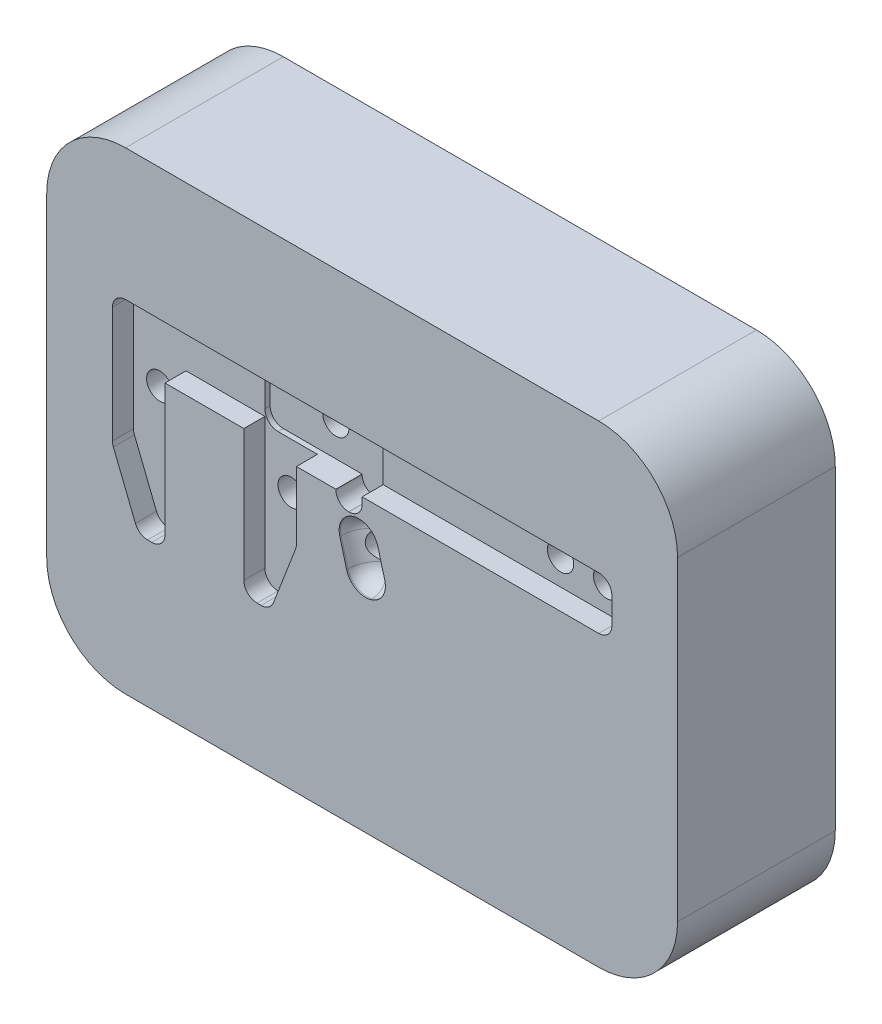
ISO-10303-21;
HEADER;
FILE_DESCRIPTION(('STEP AP214'),'2;1');
FILE_NAME('part.step','',(''),(''),'','','');
FILE_SCHEMA(('AUTOMOTIVE_DESIGN { 1 0 10303 214 1 1 1 1 }'));
ENDSEC;
DATA;
#1=APPLICATION_CONTEXT('core data for automotive mechanical design processes');
#2=APPLICATION_PROTOCOL_DEFINITION('international standard','automotive_design',2000,#1);
#3=PRODUCT_CONTEXT('',#1,'mechanical');
#4=PRODUCT('Part','Part','',(#3));
#5=PRODUCT_RELATED_PRODUCT_CATEGORY('part','',(#4));
#6=PRODUCT_DEFINITION_FORMATION('','',#4);
#7=PRODUCT_DEFINITION_CONTEXT('part definition',#1,'design');
#8=PRODUCT_DEFINITION('design','',#6,#7);
#9=PRODUCT_DEFINITION_SHAPE('','',#8);
#10=(LENGTH_UNIT() NAMED_UNIT(*) SI_UNIT(.MILLI.,.METRE.));
#11=(NAMED_UNIT(*) PLANE_ANGLE_UNIT() SI_UNIT($,.RADIAN.));
#12=(NAMED_UNIT(*) SI_UNIT($,.STERADIAN.) SOLID_ANGLE_UNIT());
#13=UNCERTAINTY_MEASURE_WITH_UNIT(LENGTH_MEASURE(1.E-05),#10,'distance_accuracy_value','');
#14=(GEOMETRIC_REPRESENTATION_CONTEXT(3) GLOBAL_UNCERTAINTY_ASSIGNED_CONTEXT((#13)) GLOBAL_UNIT_ASSIGNED_CONTEXT((#10,
#11,#12)) REPRESENTATION_CONTEXT('',''));
#15=CARTESIAN_POINT('',(0.,0.,0.));
#16=DIRECTION('',(0.,0.,1.));
#17=DIRECTION('',(1.,0.,0.));
#18=AXIS2_PLACEMENT_3D('',#15,#16,#17);
#19=CARTESIAN_POINT('',(17.,6.00000000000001,0.));
#20=DIRECTION('',(0.,0.,1.));
#21=DIRECTION('',(1.,0.,0.));
#22=AXIS2_PLACEMENT_3D('',#19,#20,#21);
#23=CYLINDRICAL_SURFACE('',#22,1.);
#24=CARTESIAN_POINT('',(17.,6.00000000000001,10.4));
#25=DIRECTION('',(0.,0.,1.));
#26=DIRECTION('',(1.,0.,0.));
#27=AXIS2_PLACEMENT_3D('',#24,#25,#26);
#28=CIRCLE('',#27,1.);
#29=CARTESIAN_POINT('',(18.,6.00000000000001,10.4));
#30=VERTEX_POINT('',#29);
#31=EDGE_CURVE('E481',#30,#30,#28,.T.);
#32=ORIENTED_EDGE('',*,*,#31,.T.);
#33=EDGE_LOOP('',(#32));
#34=FACE_BOUND('',#33,.T.);
#35=CARTESIAN_POINT('',(17.,6.00000000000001,3.));
#36=DIRECTION('',(0.,0.,-1.));
#37=DIRECTION('',(-1.,0.,0.));
#38=AXIS2_PLACEMENT_3D('',#35,#36,#37);
#39=CIRCLE('',#38,1.);
#40=CARTESIAN_POINT('',(16.,6.00000000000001,3.));
#41=VERTEX_POINT('',#40);
#42=EDGE_CURVE('E401',#41,#41,#39,.F.);
#43=ORIENTED_EDGE('',*,*,#42,.F.);
#44=EDGE_LOOP('',(#43));
#45=FACE_BOUND('',#44,.T.);
#46=ADVANCED_FACE('F38',(#34,#45),#23,.F.);
#47=CARTESIAN_POINT('',(18.,7.00000000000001,10.4));
#48=DIRECTION('',(0.,0.,-1.));
#49=DIRECTION('',(-1.,0.,0.));
#50=AXIS2_PLACEMENT_3D('',#47,#48,#49);
#51=PLANE('',#50);
#52=CARTESIAN_POINT('',(-6.99999999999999,0.,10.4));
#53=DIRECTION('',(0.,0.,1.));
#54=DIRECTION('',(1.,0.,0.));
#55=AXIS2_PLACEMENT_3D('',#52,#53,#54);
#56=CIRCLE('',#55,1.);
#57=CARTESIAN_POINT('',(-5.99999999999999,0.,10.4));
#58=VERTEX_POINT('',#57);
#59=EDGE_CURVE('E1638',#58,#58,#56,.T.);
#60=ORIENTED_EDGE('',*,*,#59,.F.);
#61=EDGE_LOOP('',(#60));
#62=FACE_BOUND('',#61,.T.);
#63=CARTESIAN_POINT('',(-17.,2.,10.4));
#64=DIRECTION('',(0.,0.,1.));
#65=DIRECTION('',(1.,0.,0.));
#66=AXIS2_PLACEMENT_3D('',#63,#64,#65);
#67=CIRCLE('',#66,1.);
#68=CARTESIAN_POINT('',(-16.,2.,10.4));
#69=VERTEX_POINT('',#68);
#70=EDGE_CURVE('E420',#69,#69,#67,.T.);
#71=ORIENTED_EDGE('',*,*,#70,.F.);
#72=EDGE_LOOP('',(#71));
#73=FACE_BOUND('',#72,.T.);
#74=DIRECTION('',(0.,1.,0.));
#75=VECTOR('',#74,1.);
#76=CARTESIAN_POINT('',(-4.99999999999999,-1.62149241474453,10.4));
#77=LINE('',#76,#75);
#78=CARTESIAN_POINT('',(-4.99999999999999,-1.62149241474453,10.4));
#79=VERTEX_POINT('',#78);
#80=CARTESIAN_POINT('',(-4.99999999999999,3.50000000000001,10.4));
#81=VERTEX_POINT('',#80);
#82=EDGE_CURVE('E679',#79,#81,#77,.T.);
#83=ORIENTED_EDGE('',*,*,#82,.T.);
#84=DIRECTION('',(-1.,0.,0.));
#85=VECTOR('',#84,1.);
#86=CARTESIAN_POINT('',(18.,3.5,10.4));
#87=LINE('',#86,#85);
#88=CARTESIAN_POINT('',(-7.99999999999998,3.50000000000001,10.4));
#89=VERTEX_POINT('',#88);
#90=EDGE_CURVE('E806',#81,#89,#87,.T.);
#91=ORIENTED_EDGE('',*,*,#90,.T.);
#92=CARTESIAN_POINT('',(-7.99999999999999,4.50000000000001,10.4));
#93=DIRECTION('',(0.,0.,-1.));
#94=DIRECTION('',(-1.,0.,0.));
#95=AXIS2_PLACEMENT_3D('',#92,#93,#94);
#96=CIRCLE('',#95,1.);
#97=CARTESIAN_POINT('',(-8.99999999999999,4.50000000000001,10.4));
#98=VERTEX_POINT('',#97);
#99=EDGE_CURVE('E803',#89,#98,#96,.T.);
#100=ORIENTED_EDGE('',*,*,#99,.T.);
#101=DIRECTION('',(0.,1.,0.));
#102=VECTOR('',#101,1.);
#103=CARTESIAN_POINT('',(-8.99999999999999,7.00000000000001,10.4));
#104=LINE('',#103,#102);
#105=CARTESIAN_POINT('',(-8.99999999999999,6.99999999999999,10.4));
#106=VERTEX_POINT('',#105);
#107=EDGE_CURVE('E800',#98,#106,#104,.T.);
#108=ORIENTED_EDGE('',*,*,#107,.T.);
#109=CARTESIAN_POINT('',(-7.99999999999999,7.,10.4));
#110=DIRECTION('',(0.,0.,-1.));
#111=DIRECTION('',(-1.,0.,0.));
#112=AXIS2_PLACEMENT_3D('',#109,#110,#111);
#113=CIRCLE('',#112,1.);
#114=CARTESIAN_POINT('',(-7.99999999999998,8.,10.4));
#115=VERTEX_POINT('',#114);
#116=EDGE_CURVE('E797',#106,#115,#113,.T.);
#117=ORIENTED_EDGE('',*,*,#116,.T.);
#118=DIRECTION('',(-1.,0.,0.));
#119=VECTOR('',#118,1.);
#120=CARTESIAN_POINT('',(18.,8.00000000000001,10.4));
#121=LINE('',#120,#119);
#122=CARTESIAN_POINT('',(-18.,8.,10.4));
#123=VERTEX_POINT('',#122);
#124=EDGE_CURVE('E630',#115,#123,#121,.T.);
#125=ORIENTED_EDGE('',*,*,#124,.T.);
#126=CARTESIAN_POINT('',(-18.,7.,10.4));
#127=DIRECTION('',(0.,0.,1.));
#128=DIRECTION('',(1.,0.,0.));
#129=AXIS2_PLACEMENT_3D('',#126,#127,#128);
#130=CIRCLE('',#129,1.);
#131=CARTESIAN_POINT('',(-19.,6.99999999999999,10.4));
#132=VERTEX_POINT('',#131);
#133=EDGE_CURVE('E634',#123,#132,#130,.T.);
#134=ORIENTED_EDGE('',*,*,#133,.T.);
#135=DIRECTION('',(0.,-1.,0.));
#136=VECTOR('',#135,1.);
#137=CARTESIAN_POINT('',(-19.,6.99999999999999,10.4));
#138=LINE('',#137,#136);
#139=CARTESIAN_POINT('',(-19.,-1.80741759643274,10.4));
#140=VERTEX_POINT('',#139);
#141=EDGE_CURVE('E637',#132,#140,#138,.T.);
#142=ORIENTED_EDGE('',*,*,#141,.T.);
#143=CARTESIAN_POINT('',(-18.,-1.80741759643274,10.4));
#144=DIRECTION('',(0.,0.,1.));
#145=DIRECTION('',(1.,0.,0.));
#146=AXIS2_PLACEMENT_3D('',#143,#144,#145);
#147=CIRCLE('',#146,0.999999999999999);
#148=CARTESIAN_POINT('',(-18.9284766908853,-2.17880827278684,10.4));
#149=VERTEX_POINT('',#148);
#150=EDGE_CURVE('E640',#140,#149,#147,.T.);
#151=ORIENTED_EDGE('',*,*,#150,.T.);
#152=DIRECTION('',(0.371390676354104,-0.928476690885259,0.));
#153=VECTOR('',#152,1.);
#154=CARTESIAN_POINT('',(-18.9284766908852,-2.17880827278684,10.4));
#155=LINE('',#154,#153);
#156=CARTESIAN_POINT('',(-17.2514437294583,-6.3713906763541,10.4));
#157=VERTEX_POINT('',#156);
#158=EDGE_CURVE('E643',#149,#157,#155,.T.);
#159=ORIENTED_EDGE('',*,*,#158,.T.);
#160=CARTESIAN_POINT('',(-16.3229670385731,-6.,10.4));
#161=DIRECTION('',(0.,0.,1.));
#162=DIRECTION('',(1.,0.,0.));
#163=AXIS2_PLACEMENT_3D('',#160,#161,#162);
#164=CIRCLE('',#163,0.999999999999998);
#165=CARTESIAN_POINT('',(-16.3229670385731,-7.,10.4));
#166=VERTEX_POINT('',#165);
#167=EDGE_CURVE('E646',#157,#166,#164,.T.);
#168=ORIENTED_EDGE('',*,*,#167,.T.);
#169=DIRECTION('',(1.,0.,0.));
#170=VECTOR('',#169,1.);
#171=CARTESIAN_POINT('',(-16.3229670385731,-7.,10.4));
#172=LINE('',#171,#170);
#173=CARTESIAN_POINT('',(-16.,-7.,10.4));
#174=VERTEX_POINT('',#173);
#175=EDGE_CURVE('E649',#166,#174,#172,.T.);
#176=ORIENTED_EDGE('',*,*,#175,.T.);
#177=CARTESIAN_POINT('',(-16.,-6.,10.4));
#178=DIRECTION('',(0.,0.,1.));
#179=DIRECTION('',(1.,0.,0.));
#180=AXIS2_PLACEMENT_3D('',#177,#178,#179);
#181=CIRCLE('',#180,1.);
#182=CARTESIAN_POINT('',(-15.,-5.99999999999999,10.4));
#183=VERTEX_POINT('',#182);
#184=EDGE_CURVE('E652',#174,#183,#181,.T.);
#185=ORIENTED_EDGE('',*,*,#184,.T.);
#186=DIRECTION('',(0.,1.,0.));
#187=VECTOR('',#186,1.);
#188=CARTESIAN_POINT('',(-15.,-5.99999999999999,10.4));
#189=LINE('',#188,#187);
#190=CARTESIAN_POINT('',(-15.,4.,10.4));
#191=VERTEX_POINT('',#190);
#192=EDGE_CURVE('E655',#183,#191,#189,.T.);
#193=ORIENTED_EDGE('',*,*,#192,.T.);
#194=DIRECTION('',(1.,0.,0.));
#195=VECTOR('',#194,1.);
#196=CARTESIAN_POINT('',(-8.99999999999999,4.,10.4));
#197=LINE('',#196,#195);
#198=CARTESIAN_POINT('',(-8.99999999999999,4.,10.4));
#199=VERTEX_POINT('',#198);
#200=EDGE_CURVE('E658',#191,#199,#197,.T.);
#201=ORIENTED_EDGE('',*,*,#200,.T.);
#202=DIRECTION('',(0.,-1.,0.));
#203=VECTOR('',#202,1.);
#204=CARTESIAN_POINT('',(-8.99999999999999,4.,10.4));
#205=LINE('',#204,#203);
#206=CARTESIAN_POINT('',(-8.99999999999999,-5.99999999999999,10.4));
#207=VERTEX_POINT('',#206);
#208=EDGE_CURVE('E661',#199,#207,#205,.T.);
#209=ORIENTED_EDGE('',*,*,#208,.T.);
#210=CARTESIAN_POINT('',(-7.99999999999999,-6.,10.4));
#211=DIRECTION('',(0.,0.,1.));
#212=DIRECTION('',(1.,0.,0.));
#213=AXIS2_PLACEMENT_3D('',#210,#211,#212);
#214=CIRCLE('',#213,1.);
#215=CARTESIAN_POINT('',(-7.99999999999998,-7.,10.4));
#216=VERTEX_POINT('',#215);
#217=EDGE_CURVE('E664',#207,#216,#214,.T.);
#218=ORIENTED_EDGE('',*,*,#217,.T.);
#219=DIRECTION('',(1.,0.,0.));
#220=VECTOR('',#219,1.);
#221=CARTESIAN_POINT('',(-7.99999999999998,-7.,10.4));
#222=LINE('',#221,#220);
#223=CARTESIAN_POINT('',(-7.68644702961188,-7.,10.4));
#224=VERTEX_POINT('',#223);
#225=EDGE_CURVE('E667',#216,#224,#222,.T.);
#226=ORIENTED_EDGE('',*,*,#225,.T.);
#227=CARTESIAN_POINT('',(-7.68644702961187,-6.,10.4));
#228=DIRECTION('',(0.,0.,1.));
#229=DIRECTION('',(-1.,0.,0.));
#230=AXIS2_PLACEMENT_3D('',#227,#228,#229);
#231=CIRCLE('',#230,1.);
#232=CARTESIAN_POINT('',(-6.75327331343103,-6.35942567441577,10.4));
#233=VERTEX_POINT('',#232);
#234=EDGE_CURVE('E670',#224,#233,#231,.T.);
#235=ORIENTED_EDGE('',*,*,#234,.T.);
#236=DIRECTION('',(0.359425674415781,0.933173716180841,0.));
#237=VECTOR('',#236,1.);
#238=CARTESIAN_POINT('',(-6.75327331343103,-6.35942567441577,10.4));
#239=LINE('',#238,#237);
#240=CARTESIAN_POINT('',(-5.06682628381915,-1.98091808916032,10.4));
#241=VERTEX_POINT('',#240);
#242=EDGE_CURVE('E673',#233,#241,#239,.T.);
#243=ORIENTED_EDGE('',*,*,#242,.T.);
#244=CARTESIAN_POINT('',(-5.99999999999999,-1.62149241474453,10.4));
#245=DIRECTION('',(0.,0.,1.));
#246=DIRECTION('',(1.,0.,0.));
#247=AXIS2_PLACEMENT_3D('',#244,#245,#246);
#248=CIRCLE('',#247,1.);
#249=EDGE_CURVE('E676',#241,#79,#248,.T.);
#250=ORIENTED_EDGE('',*,*,#249,.T.);
#251=EDGE_LOOP('',(#83,#91,#100,#108,#117,#125,#134,#142,#151,#159,#168,#176,#185,#193,#201,
#209,#218,#226,#235,#243,#250));
#252=FACE_BOUND('',#251,.T.);
#253=ADVANCED_FACE('F873',(#62,#73,#252),#51,.F.);
#254=CARTESIAN_POINT('',(18.,12.,12.));
#255=DIRECTION('',(0.,0.,-1.));
#256=DIRECTION('',(-1.,0.,0.));
#257=AXIS2_PLACEMENT_3D('',#254,#255,#256);
#258=CYLINDRICAL_SURFACE('',#257,6.);
#259=CARTESIAN_POINT('',(18.,12.,0.));
#260=DIRECTION('',(0.,0.,1.));
#261=DIRECTION('',(-1.,0.,0.));
#262=AXIS2_PLACEMENT_3D('',#259,#260,#261);
#263=CIRCLE('',#262,6.);
#264=CARTESIAN_POINT('',(24.,12.,0.));
#265=VERTEX_POINT('',#264);
#266=CARTESIAN_POINT('',(18.,18.,0.));
#267=VERTEX_POINT('',#266);
#268=EDGE_CURVE('E693',#265,#267,#263,.T.);
#269=ORIENTED_EDGE('',*,*,#268,.T.);
#270=DIRECTION('',(0.,0.,-1.));
#271=VECTOR('',#270,1.);
#272=CARTESIAN_POINT('',(18.,18.,12.));
#273=LINE('',#272,#271);
#274=CARTESIAN_POINT('',(18.,18.,12.));
#275=VERTEX_POINT('',#274);
#276=EDGE_CURVE('E788',#275,#267,#273,.T.);
#277=ORIENTED_EDGE('',*,*,#276,.F.);
#278=CARTESIAN_POINT('',(18.,12.,12.));
#279=DIRECTION('',(0.,0.,1.));
#280=DIRECTION('',(-1.,0.,0.));
#281=AXIS2_PLACEMENT_3D('',#278,#279,#280);
#282=CIRCLE('',#281,6.);
#283=CARTESIAN_POINT('',(24.,12.,12.));
#284=VERTEX_POINT('',#283);
#285=EDGE_CURVE('E750',#284,#275,#282,.T.);
#286=ORIENTED_EDGE('',*,*,#285,.F.);
#287=DIRECTION('',(0.,0.,-1.));
#288=VECTOR('',#287,1.);
#289=CARTESIAN_POINT('',(24.,12.,12.));
#290=LINE('',#289,#288);
#291=EDGE_CURVE('E767',#284,#265,#290,.T.);
#292=ORIENTED_EDGE('',*,*,#291,.T.);
#293=EDGE_LOOP('',(#269,#277,#286,#292));
#294=FACE_BOUND('',#293,.T.);
#295=ADVANCED_FACE('F40',(#294),#258,.T.);
#296=CARTESIAN_POINT('',(-18.,18.,12.));
#297=DIRECTION('',(0.,-1.,0.));
#298=DIRECTION('',(1.,0.,0.));
#299=AXIS2_PLACEMENT_3D('',#296,#297,#298);
#300=PLANE('',#299);
#301=DIRECTION('',(-1.,0.,0.));
#302=VECTOR('',#301,1.);
#303=CARTESIAN_POINT('',(-18.,18.,0.));
#304=LINE('',#303,#302);
#305=CARTESIAN_POINT('',(-18.,18.,0.));
#306=VERTEX_POINT('',#305);
#307=EDGE_CURVE('E736',#267,#306,#304,.T.);
#308=ORIENTED_EDGE('',*,*,#307,.T.);
#309=DIRECTION('',(0.,0.,-1.));
#310=VECTOR('',#309,1.);
#311=CARTESIAN_POINT('',(-18.,18.,12.));
#312=LINE('',#311,#310);
#313=CARTESIAN_POINT('',(-18.,18.,12.));
#314=VERTEX_POINT('',#313);
#315=EDGE_CURVE('E785',#314,#306,#312,.T.);
#316=ORIENTED_EDGE('',*,*,#315,.F.);
#317=DIRECTION('',(-1.,0.,0.));
#318=VECTOR('',#317,1.);
#319=CARTESIAN_POINT('',(-18.,18.,12.));
#320=LINE('',#319,#318);
#321=EDGE_CURVE('E753',#275,#314,#320,.T.);
#322=ORIENTED_EDGE('',*,*,#321,.F.);
#323=ORIENTED_EDGE('',*,*,#276,.T.);
#324=EDGE_LOOP('',(#308,#316,#322,#323));
#325=FACE_BOUND('',#324,.T.);
#326=ADVANCED_FACE('F1036',(#325),#300,.F.);
#327=CARTESIAN_POINT('',(-18.,12.,12.));
#328=DIRECTION('',(0.,0.,-1.));
#329=DIRECTION('',(-1.,0.,0.));
#330=AXIS2_PLACEMENT_3D('',#327,#328,#329);
#331=CYLINDRICAL_SURFACE('',#330,6.);
#332=CARTESIAN_POINT('',(-18.,12.,0.));
#333=DIRECTION('',(0.,0.,1.));
#334=DIRECTION('',(1.,0.,0.));
#335=AXIS2_PLACEMENT_3D('',#332,#333,#334);
#336=CIRCLE('',#335,6.);
#337=CARTESIAN_POINT('',(-24.,12.,0.));
#338=VERTEX_POINT('',#337);
#339=EDGE_CURVE('E738',#306,#338,#336,.T.);
#340=ORIENTED_EDGE('',*,*,#339,.T.);
#341=DIRECTION('',(0.,0.,-1.));
#342=VECTOR('',#341,1.);
#343=CARTESIAN_POINT('',(-24.,12.,12.));
#344=LINE('',#343,#342);
#345=CARTESIAN_POINT('',(-24.,12.,12.));
#346=VERTEX_POINT('',#345);
#347=EDGE_CURVE('E782',#346,#338,#344,.T.);
#348=ORIENTED_EDGE('',*,*,#347,.F.);
#349=CARTESIAN_POINT('',(-18.,12.,12.));
#350=DIRECTION('',(0.,0.,1.));
#351=DIRECTION('',(1.,0.,0.));
#352=AXIS2_PLACEMENT_3D('',#349,#350,#351);
#353=CIRCLE('',#352,6.);
#354=EDGE_CURVE('E755',#314,#346,#353,.T.);
#355=ORIENTED_EDGE('',*,*,#354,.F.);
#356=ORIENTED_EDGE('',*,*,#315,.T.);
#357=EDGE_LOOP('',(#340,#348,#355,#356));
#358=FACE_BOUND('',#357,.T.);
#359=ADVANCED_FACE('F1033',(#358),#331,.T.);
#360=CARTESIAN_POINT('',(-24.,12.,12.));
#361=DIRECTION('',(1.,0.,0.));
#362=DIRECTION('',(0.,0.,-1.));
#363=AXIS2_PLACEMENT_3D('',#360,#361,#362);
#364=PLANE('',#363);
#365=DIRECTION('',(0.,-1.,0.));
#366=VECTOR('',#365,1.);
#367=CARTESIAN_POINT('',(-24.,12.,0.));
#368=LINE('',#367,#366);
#369=CARTESIAN_POINT('',(-24.,-12.,0.));
#370=VERTEX_POINT('',#369);
#371=EDGE_CURVE('E740',#338,#370,#368,.T.);
#372=ORIENTED_EDGE('',*,*,#371,.T.);
#373=DIRECTION('',(0.,0.,-1.));
#374=VECTOR('',#373,1.);
#375=CARTESIAN_POINT('',(-24.,-12.,12.));
#376=LINE('',#375,#374);
#377=CARTESIAN_POINT('',(-24.,-12.,12.));
#378=VERTEX_POINT('',#377);
#379=EDGE_CURVE('E779',#378,#370,#376,.T.);
#380=ORIENTED_EDGE('',*,*,#379,.F.);
#381=DIRECTION('',(0.,-1.,0.));
#382=VECTOR('',#381,1.);
#383=CARTESIAN_POINT('',(-24.,12.,12.));
#384=LINE('',#383,#382);
#385=EDGE_CURVE('E757',#346,#378,#384,.T.);
#386=ORIENTED_EDGE('',*,*,#385,.F.);
#387=ORIENTED_EDGE('',*,*,#347,.T.);
#388=EDGE_LOOP('',(#372,#380,#386,#387));
#389=FACE_BOUND('',#388,.T.);
#390=ADVANCED_FACE('F1029',(#389),#364,.F.);
#391=CARTESIAN_POINT('',(-18.,-12.,12.));
#392=DIRECTION('',(0.,0.,-1.));
#393=DIRECTION('',(-1.,0.,0.));
#394=AXIS2_PLACEMENT_3D('',#391,#392,#393);
#395=CYLINDRICAL_SURFACE('',#394,6.);
#396=CARTESIAN_POINT('',(-18.,-12.,0.));
#397=DIRECTION('',(0.,0.,1.));
#398=DIRECTION('',(1.,0.,0.));
#399=AXIS2_PLACEMENT_3D('',#396,#397,#398);
#400=CIRCLE('',#399,6.);
#401=CARTESIAN_POINT('',(-18.,-18.,0.));
#402=VERTEX_POINT('',#401);
#403=EDGE_CURVE('E742',#370,#402,#400,.T.);
#404=ORIENTED_EDGE('',*,*,#403,.T.);
#405=DIRECTION('',(0.,0.,-1.));
#406=VECTOR('',#405,1.);
#407=CARTESIAN_POINT('',(-18.,-18.,12.));
#408=LINE('',#407,#406);
#409=CARTESIAN_POINT('',(-18.,-18.,12.));
#410=VERTEX_POINT('',#409);
#411=EDGE_CURVE('E776',#410,#402,#408,.T.);
#412=ORIENTED_EDGE('',*,*,#411,.F.);
#413=CARTESIAN_POINT('',(-18.,-12.,12.));
#414=DIRECTION('',(0.,0.,1.));
#415=DIRECTION('',(1.,0.,0.));
#416=AXIS2_PLACEMENT_3D('',#413,#414,#415);
#417=CIRCLE('',#416,6.);
#418=EDGE_CURVE('E759',#378,#410,#417,.T.);
#419=ORIENTED_EDGE('',*,*,#418,.F.);
#420=ORIENTED_EDGE('',*,*,#379,.T.);
#421=EDGE_LOOP('',(#404,#412,#419,#420));
#422=FACE_BOUND('',#421,.T.);
#423=ADVANCED_FACE('F1025',(#422),#395,.T.);
#424=CARTESIAN_POINT('',(-18.,-18.,12.));
#425=DIRECTION('',(0.,1.,0.));
#426=DIRECTION('',(-1.,0.,0.));
#427=AXIS2_PLACEMENT_3D('',#424,#425,#426);
#428=PLANE('',#427);
#429=DIRECTION('',(1.,0.,0.));
#430=VECTOR('',#429,1.);
#431=CARTESIAN_POINT('',(-18.,-18.,0.));
#432=LINE('',#431,#430);
#433=CARTESIAN_POINT('',(18.,-18.,0.));
#434=VERTEX_POINT('',#433);
#435=EDGE_CURVE('E744',#402,#434,#432,.T.);
#436=ORIENTED_EDGE('',*,*,#435,.T.);
#437=DIRECTION('',(0.,0.,-1.));
#438=VECTOR('',#437,1.);
#439=CARTESIAN_POINT('',(18.,-18.,12.));
#440=LINE('',#439,#438);
#441=CARTESIAN_POINT('',(18.,-18.,12.));
#442=VERTEX_POINT('',#441);
#443=EDGE_CURVE('E773',#442,#434,#440,.T.);
#444=ORIENTED_EDGE('',*,*,#443,.F.);
#445=DIRECTION('',(1.,0.,0.));
#446=VECTOR('',#445,1.);
#447=CARTESIAN_POINT('',(-18.,-18.,12.));
#448=LINE('',#447,#446);
#449=EDGE_CURVE('E761',#410,#442,#448,.T.);
#450=ORIENTED_EDGE('',*,*,#449,.F.);
#451=ORIENTED_EDGE('',*,*,#411,.T.);
#452=EDGE_LOOP('',(#436,#444,#450,#451));
#453=FACE_BOUND('',#452,.T.);
#454=ADVANCED_FACE('F1021',(#453),#428,.F.);
#455=CARTESIAN_POINT('',(18.,-12.,12.));
#456=DIRECTION('',(0.,0.,-1.));
#457=DIRECTION('',(-1.,0.,0.));
#458=AXIS2_PLACEMENT_3D('',#455,#456,#457);
#459=CYLINDRICAL_SURFACE('',#458,6.);
#460=CARTESIAN_POINT('',(18.,-12.,0.));
#461=DIRECTION('',(0.,0.,1.));
#462=DIRECTION('',(1.,0.,0.));
#463=AXIS2_PLACEMENT_3D('',#460,#461,#462);
#464=CIRCLE('',#463,6.);
#465=CARTESIAN_POINT('',(24.,-12.,0.));
#466=VERTEX_POINT('',#465);
#467=EDGE_CURVE('E746',#434,#466,#464,.T.);
#468=ORIENTED_EDGE('',*,*,#467,.T.);
#469=DIRECTION('',(0.,0.,-1.));
#470=VECTOR('',#469,1.);
#471=CARTESIAN_POINT('',(24.,-12.,12.));
#472=LINE('',#471,#470);
#473=CARTESIAN_POINT('',(24.,-12.,12.));
#474=VERTEX_POINT('',#473);
#475=EDGE_CURVE('E770',#474,#466,#472,.T.);
#476=ORIENTED_EDGE('',*,*,#475,.F.);
#477=CARTESIAN_POINT('',(18.,-12.,12.));
#478=DIRECTION('',(0.,0.,1.));
#479=DIRECTION('',(1.,0.,0.));
#480=AXIS2_PLACEMENT_3D('',#477,#478,#479);
#481=CIRCLE('',#480,6.);
#482=EDGE_CURVE('E763',#442,#474,#481,.T.);
#483=ORIENTED_EDGE('',*,*,#482,.F.);
#484=ORIENTED_EDGE('',*,*,#443,.T.);
#485=EDGE_LOOP('',(#468,#476,#483,#484));
#486=FACE_BOUND('',#485,.T.);
#487=ADVANCED_FACE('F1017',(#486),#459,.T.);
#488=CARTESIAN_POINT('',(24.,12.,12.));
#489=DIRECTION('',(-1.,0.,0.));
#490=DIRECTION('',(0.,-1.,0.));
#491=AXIS2_PLACEMENT_3D('',#488,#489,#490);
#492=PLANE('',#491);
#493=DIRECTION('',(0.,1.,0.));
#494=VECTOR('',#493,1.);
#495=CARTESIAN_POINT('',(24.,12.,0.));
#496=LINE('',#495,#494);
#497=EDGE_CURVE('E748',#466,#265,#496,.T.);
#498=ORIENTED_EDGE('',*,*,#497,.T.);
#499=ORIENTED_EDGE('',*,*,#291,.F.);
#500=DIRECTION('',(0.,1.,0.));
#501=VECTOR('',#500,1.);
#502=CARTESIAN_POINT('',(24.,12.,12.));
#503=LINE('',#502,#501);
#504=EDGE_CURVE('E765',#474,#284,#503,.T.);
#505=ORIENTED_EDGE('',*,*,#504,.F.);
#506=ORIENTED_EDGE('',*,*,#475,.T.);
#507=EDGE_LOOP('',(#498,#499,#505,#506));
#508=FACE_BOUND('',#507,.T.);
#509=ADVANCED_FACE('F1014',(#508),#492,.F.);
#510=CARTESIAN_POINT('',(18.,12.,12.));
#511=DIRECTION('',(0.,0.,-1.));
#512=DIRECTION('',(-1.,0.,0.));
#513=AXIS2_PLACEMENT_3D('',#510,#511,#512);
#514=PLANE('',#513);
#515=CARTESIAN_POINT('',(-0.249944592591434,0.932805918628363,12.));
#516=DIRECTION('',(0.,0.,-1.));
#517=DIRECTION('',(-1.,0.,0.));
#518=AXIS2_PLACEMENT_3D('',#515,#516,#517);
#519=CIRCLE('',#518,1.5);
#520=CARTESIAN_POINT('',(-1.69883333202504,0.544577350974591,12.));
#521=VERTEX_POINT('',#520);
#522=CARTESIAN_POINT('',(-0.638173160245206,2.38169465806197,12.));
#523=VERTEX_POINT('',#522);
#524=EDGE_CURVE('E65',#521,#523,#519,.T.);
#525=ORIENTED_EDGE('',*,*,#524,.T.);
#526=CARTESIAN_POINT('',(-0.249944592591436,0.932805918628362,12.));
#527=DIRECTION('',(0.,0.,-1.));
#528=DIRECTION('',(-1.,0.,0.));
#529=AXIS2_PLACEMENT_3D('',#526,#527,#528);
#530=CIRCLE('',#529,1.5);
#531=CARTESIAN_POINT('',(1.19894414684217,1.32103448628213,12.));
#532=VERTEX_POINT('',#531);
#533=EDGE_CURVE('E51',#523,#532,#530,.T.);
#534=ORIENTED_EDGE('',*,*,#533,.T.);
#535=DIRECTION('',(-0.258819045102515,0.96592582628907,0.));
#536=VECTOR('',#535,1.);
#537=CARTESIAN_POINT('',(2.10481080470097,-2.05970590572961,12.));
#538=LINE('',#537,#536);
#539=CARTESIAN_POINT('',(1.7165822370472,-0.610817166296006,12.));
#540=VERTEX_POINT('',#539);
#541=EDGE_CURVE('E476',#540,#532,#538,.T.);
#542=ORIENTED_EDGE('',*,*,#541,.F.);
#543=CARTESIAN_POINT('',(0.267693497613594,-0.999045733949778,12.));
#544=DIRECTION('',(0.,0.,-1.));
#545=DIRECTION('',(-1.,0.,0.));
#546=AXIS2_PLACEMENT_3D('',#543,#544,#545);
#547=CIRCLE('',#546,1.5);
#548=CARTESIAN_POINT('',(0.655922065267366,-2.44793447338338,12.));
#549=VERTEX_POINT('',#548);
#550=EDGE_CURVE('E390',#540,#549,#547,.T.);
#551=ORIENTED_EDGE('',*,*,#550,.T.);
#552=CARTESIAN_POINT('',(0.267693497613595,-0.999045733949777,12.));
#553=DIRECTION('',(0.,0.,-1.));
#554=DIRECTION('',(-1.,0.,0.));
#555=AXIS2_PLACEMENT_3D('',#552,#553,#554);
#556=CIRCLE('',#555,1.5);
#557=CARTESIAN_POINT('',(-1.18119524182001,-1.38727430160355,12.));
#558=VERTEX_POINT('',#557);
#559=EDGE_CURVE('E397',#549,#558,#556,.T.);
#560=ORIENTED_EDGE('',*,*,#559,.T.);
#561=DIRECTION('',(-0.258819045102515,0.96592582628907,0.));
#562=VECTOR('',#561,1.);
#563=CARTESIAN_POINT('',(-0.792966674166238,-2.83616304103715,12.));
#564=LINE('',#563,#562);
#565=EDGE_CURVE('E479',#558,#521,#564,.T.);
#566=ORIENTED_EDGE('',*,*,#565,.T.);
#567=EDGE_LOOP('',(#525,#534,#542,#551,#560,#566));
#568=FACE_BOUND('',#567,.T.);
#569=DIRECTION('',(0.,-1.,0.));
#570=VECTOR('',#569,1.);
#571=CARTESIAN_POINT('',(-2.,3.50000000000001,12.));
#572=LINE('',#571,#570);
#573=CARTESIAN_POINT('',(-2.,3.50000000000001,12.));
#574=VERTEX_POINT('',#573);
#575=CARTESIAN_POINT('',(-2.,3.47000000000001,12.));
#576=VERTEX_POINT('',#575);
#577=EDGE_CURVE('E491',#574,#576,#572,.T.);
#578=ORIENTED_EDGE('',*,*,#577,.F.);
#579=DIRECTION('',(1.,0.,0.));
#580=VECTOR('',#579,1.);
#581=CARTESIAN_POINT('',(-7.99999999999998,3.50000000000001,12.));
#582=LINE('',#581,#580);
#583=CARTESIAN_POINT('',(-4.99999999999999,3.50000000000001,12.));
#584=VERTEX_POINT('',#583);
#585=EDGE_CURVE('E489',#584,#574,#582,.T.);
#586=ORIENTED_EDGE('',*,*,#585,.F.);
#587=DIRECTION('',(0.,1.,0.));
#588=VECTOR('',#587,1.);
#589=CARTESIAN_POINT('',(-4.99999999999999,-1.62149241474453,12.));
#590=LINE('',#589,#588);
#591=CARTESIAN_POINT('',(-4.99999999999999,-1.62149241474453,12.));
#592=VERTEX_POINT('',#591);
#593=EDGE_CURVE('E616',#592,#584,#590,.T.);
#594=ORIENTED_EDGE('',*,*,#593,.F.);
#595=CARTESIAN_POINT('',(-5.99999999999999,-1.62149241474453,12.));
#596=DIRECTION('',(0.,0.,1.));
#597=DIRECTION('',(1.,0.,0.));
#598=AXIS2_PLACEMENT_3D('',#595,#596,#597);
#599=CIRCLE('',#598,1.);
#600=CARTESIAN_POINT('',(-5.06682628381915,-1.98091808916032,12.));
#601=VERTEX_POINT('',#600);
#602=EDGE_CURVE('E613',#601,#592,#599,.T.);
#603=ORIENTED_EDGE('',*,*,#602,.F.);
#604=DIRECTION('',(0.359425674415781,0.933173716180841,0.));
#605=VECTOR('',#604,1.);
#606=CARTESIAN_POINT('',(-6.75327331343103,-6.35942567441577,12.));
#607=LINE('',#606,#605);
#608=CARTESIAN_POINT('',(-6.75327331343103,-6.35942567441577,12.));
#609=VERTEX_POINT('',#608);
#610=EDGE_CURVE('E610',#609,#601,#607,.T.);
#611=ORIENTED_EDGE('',*,*,#610,.F.);
#612=CARTESIAN_POINT('',(-7.68644702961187,-6.,12.));
#613=DIRECTION('',(0.,0.,1.));
#614=DIRECTION('',(-1.,0.,0.));
#615=AXIS2_PLACEMENT_3D('',#612,#613,#614);
#616=CIRCLE('',#615,1.);
#617=CARTESIAN_POINT('',(-7.68644702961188,-7.,12.));
#618=VERTEX_POINT('',#617);
#619=EDGE_CURVE('E607',#618,#609,#616,.T.);
#620=ORIENTED_EDGE('',*,*,#619,.F.);
#621=DIRECTION('',(1.,0.,0.));
#622=VECTOR('',#621,1.);
#623=CARTESIAN_POINT('',(-7.99999999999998,-7.,12.));
#624=LINE('',#623,#622);
#625=CARTESIAN_POINT('',(-7.99999999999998,-7.,12.));
#626=VERTEX_POINT('',#625);
#627=EDGE_CURVE('E604',#626,#618,#624,.T.);
#628=ORIENTED_EDGE('',*,*,#627,.F.);
#629=CARTESIAN_POINT('',(-7.99999999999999,-6.,12.));
#630=DIRECTION('',(0.,0.,1.));
#631=DIRECTION('',(1.,0.,0.));
#632=AXIS2_PLACEMENT_3D('',#629,#630,#631);
#633=CIRCLE('',#632,1.);
#634=CARTESIAN_POINT('',(-8.99999999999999,-5.99999999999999,12.));
#635=VERTEX_POINT('',#634);
#636=EDGE_CURVE('E601',#635,#626,#633,.T.);
#637=ORIENTED_EDGE('',*,*,#636,.F.);
#638=DIRECTION('',(0.,-1.,0.));
#639=VECTOR('',#638,1.);
#640=CARTESIAN_POINT('',(-8.99999999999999,4.,12.));
#641=LINE('',#640,#639);
#642=CARTESIAN_POINT('',(-8.99999999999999,4.,12.));
#643=VERTEX_POINT('',#642);
#644=EDGE_CURVE('E598',#643,#635,#641,.T.);
#645=ORIENTED_EDGE('',*,*,#644,.F.);
#646=DIRECTION('',(1.,0.,0.));
#647=VECTOR('',#646,1.);
#648=CARTESIAN_POINT('',(-8.99999999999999,4.,12.));
#649=LINE('',#648,#647);
#650=CARTESIAN_POINT('',(-15.,4.,12.));
#651=VERTEX_POINT('',#650);
#652=EDGE_CURVE('E595',#651,#643,#649,.T.);
#653=ORIENTED_EDGE('',*,*,#652,.F.);
#654=DIRECTION('',(0.,1.,0.));
#655=VECTOR('',#654,1.);
#656=CARTESIAN_POINT('',(-15.,-5.99999999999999,12.));
#657=LINE('',#656,#655);
#658=CARTESIAN_POINT('',(-15.,-5.99999999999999,12.));
#659=VERTEX_POINT('',#658);
#660=EDGE_CURVE('E592',#659,#651,#657,.T.);
#661=ORIENTED_EDGE('',*,*,#660,.F.);
#662=CARTESIAN_POINT('',(-16.,-6.,12.));
#663=DIRECTION('',(0.,0.,1.));
#664=DIRECTION('',(1.,0.,0.));
#665=AXIS2_PLACEMENT_3D('',#662,#663,#664);
#666=CIRCLE('',#665,1.);
#667=CARTESIAN_POINT('',(-16.,-7.,12.));
#668=VERTEX_POINT('',#667);
#669=EDGE_CURVE('E589',#668,#659,#666,.T.);
#670=ORIENTED_EDGE('',*,*,#669,.F.);
#671=DIRECTION('',(1.,0.,0.));
#672=VECTOR('',#671,1.);
#673=CARTESIAN_POINT('',(-16.3229670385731,-7.,12.));
#674=LINE('',#673,#672);
#675=CARTESIAN_POINT('',(-16.3229670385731,-7.,12.));
#676=VERTEX_POINT('',#675);
#677=EDGE_CURVE('E586',#676,#668,#674,.T.);
#678=ORIENTED_EDGE('',*,*,#677,.F.);
#679=CARTESIAN_POINT('',(-16.3229670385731,-6.,12.));
#680=DIRECTION('',(0.,0.,1.));
#681=DIRECTION('',(1.,0.,0.));
#682=AXIS2_PLACEMENT_3D('',#679,#680,#681);
#683=CIRCLE('',#682,0.999999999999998);
#684=CARTESIAN_POINT('',(-17.2514437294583,-6.3713906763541,12.));
#685=VERTEX_POINT('',#684);
#686=EDGE_CURVE('E583',#685,#676,#683,.T.);
#687=ORIENTED_EDGE('',*,*,#686,.F.);
#688=DIRECTION('',(0.371390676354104,-0.928476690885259,0.));
#689=VECTOR('',#688,1.);
#690=CARTESIAN_POINT('',(-18.9284766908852,-2.17880827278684,12.));
#691=LINE('',#690,#689);
#692=CARTESIAN_POINT('',(-18.9284766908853,-2.17880827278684,12.));
#693=VERTEX_POINT('',#692);
#694=EDGE_CURVE('E580',#693,#685,#691,.T.);
#695=ORIENTED_EDGE('',*,*,#694,.F.);
#696=CARTESIAN_POINT('',(-18.,-1.80741759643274,12.));
#697=DIRECTION('',(0.,0.,1.));
#698=DIRECTION('',(1.,0.,0.));
#699=AXIS2_PLACEMENT_3D('',#696,#697,#698);
#700=CIRCLE('',#699,0.999999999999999);
#701=CARTESIAN_POINT('',(-19.,-1.80741759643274,12.));
#702=VERTEX_POINT('',#701);
#703=EDGE_CURVE('E577',#702,#693,#700,.T.);
#704=ORIENTED_EDGE('',*,*,#703,.F.);
#705=DIRECTION('',(0.,-1.,0.));
#706=VECTOR('',#705,1.);
#707=CARTESIAN_POINT('',(-19.,6.99999999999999,12.));
#708=LINE('',#707,#706);
#709=CARTESIAN_POINT('',(-19.,6.99999999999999,12.));
#710=VERTEX_POINT('',#709);
#711=EDGE_CURVE('E574',#710,#702,#708,.T.);
#712=ORIENTED_EDGE('',*,*,#711,.F.);
#713=CARTESIAN_POINT('',(-18.,7.,12.));
#714=DIRECTION('',(0.,0.,1.));
#715=DIRECTION('',(1.,0.,0.));
#716=AXIS2_PLACEMENT_3D('',#713,#714,#715);
#717=CIRCLE('',#716,1.);
#718=CARTESIAN_POINT('',(-18.,8.,12.));
#719=VERTEX_POINT('',#718);
#720=EDGE_CURVE('E571',#719,#710,#717,.T.);
#721=ORIENTED_EDGE('',*,*,#720,.F.);
#722=DIRECTION('',(-1.,0.,0.));
#723=VECTOR('',#722,1.);
#724=CARTESIAN_POINT('',(18.,8.00000000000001,12.));
#725=LINE('',#724,#723);
#726=CARTESIAN_POINT('',(18.,8.00000000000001,12.));
#727=VERTEX_POINT('',#726);
#728=EDGE_CURVE('E569',#727,#719,#725,.T.);
#729=ORIENTED_EDGE('',*,*,#728,.F.);
#730=CARTESIAN_POINT('',(18.,7.00000000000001,12.));
#731=DIRECTION('',(0.,0.,1.));
#732=DIRECTION('',(-1.,0.,0.));
#733=AXIS2_PLACEMENT_3D('',#730,#731,#732);
#734=CIRCLE('',#733,1.);
#735=CARTESIAN_POINT('',(19.,7.,12.));
#736=VERTEX_POINT('',#735);
#737=EDGE_CURVE('E567',#736,#727,#734,.T.);
#738=ORIENTED_EDGE('',*,*,#737,.F.);
#739=DIRECTION('',(0.,1.,0.));
#740=VECTOR('',#739,1.);
#741=CARTESIAN_POINT('',(19.,5.00000000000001,12.));
#742=LINE('',#741,#740);
#743=CARTESIAN_POINT('',(19.,5.00000000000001,12.));
#744=VERTEX_POINT('',#743);
#745=EDGE_CURVE('E624',#744,#736,#742,.T.);
#746=ORIENTED_EDGE('',*,*,#745,.F.);
#747=CARTESIAN_POINT('',(18.,5.,12.));
#748=DIRECTION('',(0.,0.,1.));
#749=DIRECTION('',(1.,0.,0.));
#750=AXIS2_PLACEMENT_3D('',#747,#748,#749);
#751=CIRCLE('',#750,1.);
#752=CARTESIAN_POINT('',(18.,4.,12.));
#753=VERTEX_POINT('',#752);
#754=EDGE_CURVE('E621',#753,#744,#751,.T.);
#755=ORIENTED_EDGE('',*,*,#754,.F.);
#756=DIRECTION('',(1.,0.,0.));
#757=VECTOR('',#756,1.);
#758=CARTESIAN_POINT('',(18.,4.,12.));
#759=LINE('',#758,#757);
#760=CARTESIAN_POINT('',(0.,4.,12.));
#761=VERTEX_POINT('',#760);
#762=EDGE_CURVE('E619',#761,#753,#759,.T.);
#763=ORIENTED_EDGE('',*,*,#762,.F.);
#764=DIRECTION('',(0.,1.,0.));
#765=VECTOR('',#764,1.);
#766=CARTESIAN_POINT('',(0.,6.99999999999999,12.));
#767=LINE('',#766,#765);
#768=CARTESIAN_POINT('',(0.,3.50000000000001,12.));
#769=VERTEX_POINT('',#768);
#770=EDGE_CURVE('E487',#769,#761,#767,.T.);
#771=ORIENTED_EDGE('',*,*,#770,.F.);
#772=CARTESIAN_POINT('',(-0.999999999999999,3.50000000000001,12.));
#773=DIRECTION('',(0.,0.,1.));
#774=DIRECTION('',(-1.,0.,0.));
#775=AXIS2_PLACEMENT_3D('',#772,#773,#774);
#776=CIRCLE('',#775,1.);
#777=CARTESIAN_POINT('',(-1.00000000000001,2.50000000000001,12.));
#778=VERTEX_POINT('',#777);
#779=EDGE_CURVE('E484',#778,#769,#776,.T.);
#780=ORIENTED_EDGE('',*,*,#779,.F.);
#781=DIRECTION('',(1.,0.,0.));
#782=VECTOR('',#781,1.);
#783=CARTESIAN_POINT('',(-1.02999999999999,2.50000000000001,12.));
#784=LINE('',#783,#782);
#785=CARTESIAN_POINT('',(-1.02999999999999,2.50000000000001,12.));
#786=VERTEX_POINT('',#785);
#787=EDGE_CURVE('E497',#786,#778,#784,.T.);
#788=ORIENTED_EDGE('',*,*,#787,.F.);
#789=CARTESIAN_POINT('',(-1.03,3.47000000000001,12.));
#790=DIRECTION('',(0.,0.,1.));
#791=DIRECTION('',(1.,0.,0.));
#792=AXIS2_PLACEMENT_3D('',#789,#790,#791);
#793=CIRCLE('',#792,0.97);
#794=EDGE_CURVE('E494',#576,#786,#793,.T.);
#795=ORIENTED_EDGE('',*,*,#794,.F.);
#796=EDGE_LOOP('',(#578,#586,#594,#603,#611,#620,#628,#637,#645,#653,#661,#670,#678,#687,#695,
#704,#712,#721,#729,#738,#746,#755,#763,#771,#780,#788,#795));
#797=FACE_BOUND('',#796,.T.);
#798=ORIENTED_EDGE('',*,*,#285,.T.);
#799=ORIENTED_EDGE('',*,*,#321,.T.);
#800=ORIENTED_EDGE('',*,*,#354,.T.);
#801=ORIENTED_EDGE('',*,*,#385,.T.);
#802=ORIENTED_EDGE('',*,*,#418,.T.);
#803=ORIENTED_EDGE('',*,*,#449,.T.);
#804=ORIENTED_EDGE('',*,*,#482,.T.);
#805=ORIENTED_EDGE('',*,*,#504,.T.);
#806=EDGE_LOOP('',(#798,#799,#800,#801,#802,#803,#804,#805));
#807=FACE_BOUND('',#806,.T.);
#808=ADVANCED_FACE('F841',(#568,#797,#807),#514,.F.);
#809=CARTESIAN_POINT('',(18.,12.,0.));
#810=DIRECTION('',(0.,0.,-1.));
#811=DIRECTION('',(-1.,0.,0.));
#812=AXIS2_PLACEMENT_3D('',#809,#810,#811);
#813=PLANE('',#812);
#814=CARTESIAN_POINT('',(0.,0.,0.));
#815=DIRECTION('',(0.,0.,1.));
#816=DIRECTION('',(1.,0.,0.));
#817=AXIS2_PLACEMENT_3D('',#814,#815,#816);
#818=CIRCLE('',#817,1.);
#819=CARTESIAN_POINT('',(1.,0.,0.));
#820=VERTEX_POINT('',#819);
#821=EDGE_CURVE('E1724',#820,#820,#818,.T.);
#822=ORIENTED_EDGE('',*,*,#821,.T.);
#823=EDGE_LOOP('',(#822));
#824=FACE_BOUND('',#823,.T.);
#825=CARTESIAN_POINT('',(-6.99999999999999,0.,0.));
#826=DIRECTION('',(0.,0.,1.));
#827=DIRECTION('',(1.,0.,0.));
#828=AXIS2_PLACEMENT_3D('',#825,#826,#827);
#829=CIRCLE('',#828,1.);
#830=CARTESIAN_POINT('',(-5.99999999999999,0.,0.));
#831=VERTEX_POINT('',#830);
#832=EDGE_CURVE('E1641',#831,#831,#829,.T.);
#833=ORIENTED_EDGE('',*,*,#832,.T.);
#834=EDGE_LOOP('',(#833));
#835=FACE_BOUND('',#834,.T.);
#836=CARTESIAN_POINT('',(-17.,2.,0.));
#837=DIRECTION('',(0.,0.,1.));
#838=DIRECTION('',(1.,0.,0.));
#839=AXIS2_PLACEMENT_3D('',#836,#837,#838);
#840=CIRCLE('',#839,1.);
#841=CARTESIAN_POINT('',(-16.,2.,0.));
#842=VERTEX_POINT('',#841);
#843=EDGE_CURVE('E415',#842,#842,#840,.T.);
#844=ORIENTED_EDGE('',*,*,#843,.T.);
#845=EDGE_LOOP('',(#844));
#846=FACE_BOUND('',#845,.T.);
#847=CARTESIAN_POINT('',(-4.,6.,0.));
#848=DIRECTION('',(0.,0.,1.));
#849=DIRECTION('',(1.,0.,0.));
#850=AXIS2_PLACEMENT_3D('',#847,#848,#849);
#851=CIRCLE('',#850,1.);
#852=CARTESIAN_POINT('',(-3.,6.,0.));
#853=VERTEX_POINT('',#852);
#854=EDGE_CURVE('E408',#853,#853,#851,.T.);
#855=ORIENTED_EDGE('',*,*,#854,.T.);
#856=EDGE_LOOP('',(#855));
#857=FACE_BOUND('',#856,.T.);
#858=CARTESIAN_POINT('',(13.5,6.00000000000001,0.));
#859=DIRECTION('',(0.,0.,1.));
#860=DIRECTION('',(1.,0.,0.));
#861=AXIS2_PLACEMENT_3D('',#858,#859,#860);
#862=CIRCLE('',#861,1.);
#863=CARTESIAN_POINT('',(14.5,6.00000000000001,0.));
#864=VERTEX_POINT('',#863);
#865=EDGE_CURVE('E412',#864,#864,#862,.T.);
#866=ORIENTED_EDGE('',*,*,#865,.T.);
#867=EDGE_LOOP('',(#866));
#868=FACE_BOUND('',#867,.T.);
#869=CARTESIAN_POINT('',(17.,6.00000000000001,0.));
#870=DIRECTION('',(0.,0.,-1.));
#871=DIRECTION('',(-1.,0.,0.));
#872=AXIS2_PLACEMENT_3D('',#869,#870,#871);
#873=CIRCLE('',#872,2.);
#874=CARTESIAN_POINT('',(15.,6.00000000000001,0.));
#875=VERTEX_POINT('',#874);
#876=EDGE_CURVE('E426',#875,#875,#873,.T.);
#877=ORIENTED_EDGE('',*,*,#876,.F.);
#878=EDGE_LOOP('',(#877));
#879=FACE_BOUND('',#878,.T.);
#880=CARTESIAN_POINT('',(-18.,12.,0.));
#881=DIRECTION('',(0.,0.,-1.));
#882=DIRECTION('',(-1.,0.,0.));
#883=AXIS2_PLACEMENT_3D('',#880,#881,#882);
#884=CIRCLE('',#883,1.64999999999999);
#885=CARTESIAN_POINT('',(-19.65,12.,0.));
#886=VERTEX_POINT('',#885);
#887=EDGE_CURVE('E433',#886,#886,#884,.T.);
#888=ORIENTED_EDGE('',*,*,#887,.F.);
#889=EDGE_LOOP('',(#888));
#890=FACE_BOUND('',#889,.T.);
#891=CARTESIAN_POINT('',(18.,12.,0.));
#892=DIRECTION('',(0.,0.,-1.));
#893=DIRECTION('',(-1.,0.,0.));
#894=AXIS2_PLACEMENT_3D('',#891,#892,#893);
#895=CIRCLE('',#894,1.64999999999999);
#896=CARTESIAN_POINT('',(16.35,12.,0.));
#897=VERTEX_POINT('',#896);
#898=EDGE_CURVE('E439',#897,#897,#895,.T.);
#899=ORIENTED_EDGE('',*,*,#898,.F.);
#900=EDGE_LOOP('',(#899));
#901=FACE_BOUND('',#900,.T.);
#902=CARTESIAN_POINT('',(18.,-12.,0.));
#903=DIRECTION('',(0.,0.,-1.));
#904=DIRECTION('',(-1.,0.,0.));
#905=AXIS2_PLACEMENT_3D('',#902,#903,#904);
#906=CIRCLE('',#905,1.64999999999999);
#907=CARTESIAN_POINT('',(16.35,-12.,0.));
#908=VERTEX_POINT('',#907);
#909=EDGE_CURVE('E445',#908,#908,#906,.T.);
#910=ORIENTED_EDGE('',*,*,#909,.F.);
#911=EDGE_LOOP('',(#910));
#912=FACE_BOUND('',#911,.T.);
#913=CARTESIAN_POINT('',(-18.,-12.,0.));
#914=DIRECTION('',(0.,0.,-1.));
#915=DIRECTION('',(-1.,0.,0.));
#916=AXIS2_PLACEMENT_3D('',#913,#914,#915);
#917=CIRCLE('',#916,1.64999999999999);
#918=CARTESIAN_POINT('',(-19.65,-12.,0.));
#919=VERTEX_POINT('',#918);
#920=EDGE_CURVE('E451',#919,#919,#917,.T.);
#921=ORIENTED_EDGE('',*,*,#920,.F.);
#922=EDGE_LOOP('',(#921));
#923=FACE_BOUND('',#922,.T.);
#924=ORIENTED_EDGE('',*,*,#268,.F.);
#925=ORIENTED_EDGE('',*,*,#497,.F.);
#926=ORIENTED_EDGE('',*,*,#467,.F.);
#927=ORIENTED_EDGE('',*,*,#435,.F.);
#928=ORIENTED_EDGE('',*,*,#403,.F.);
#929=ORIENTED_EDGE('',*,*,#371,.F.);
#930=ORIENTED_EDGE('',*,*,#339,.F.);
#931=ORIENTED_EDGE('',*,*,#307,.F.);
#932=EDGE_LOOP('',(#924,#925,#926,#927,#928,#929,#930,#931));
#933=FACE_BOUND('',#932,.T.);
#934=ADVANCED_FACE('F1007',(#824,#835,#846,#857,#868,#879,#890,#901,#912,#923,#933),#813,.T.);
#935=CARTESIAN_POINT('',(18.,7.00000000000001,10.4));
#936=DIRECTION('',(0.,0.,1.));
#937=DIRECTION('',(1.,0.,0.));
#938=AXIS2_PLACEMENT_3D('',#935,#936,#937);
#939=CYLINDRICAL_SURFACE('',#938,1.);
#940=ORIENTED_EDGE('',*,*,#737,.T.);
#941=DIRECTION('',(0.,0.,1.));
#942=VECTOR('',#941,1.);
#943=CARTESIAN_POINT('',(18.,8.00000000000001,10.4));
#944=LINE('',#943,#942);
#945=CARTESIAN_POINT('',(18.,8.00000000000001,10.4));
#946=VERTEX_POINT('',#945);
#947=EDGE_CURVE('E690',#946,#727,#944,.T.);
#948=ORIENTED_EDGE('',*,*,#947,.F.);
#949=CARTESIAN_POINT('',(18.,7.00000000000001,10.4));
#950=DIRECTION('',(0.,0.,1.));
#951=DIRECTION('',(-1.,0.,0.));
#952=AXIS2_PLACEMENT_3D('',#949,#950,#951);
#953=CIRCLE('',#952,1.);
#954=CARTESIAN_POINT('',(19.,7.,10.4));
#955=VERTEX_POINT('',#954);
#956=EDGE_CURVE('E627',#955,#946,#953,.T.);
#957=ORIENTED_EDGE('',*,*,#956,.F.);
#958=DIRECTION('',(0.,0.,1.));
#959=VECTOR('',#958,1.);
#960=CARTESIAN_POINT('',(19.,7.,10.4));
#961=LINE('',#960,#959);
#962=EDGE_CURVE('E691',#955,#736,#961,.T.);
#963=ORIENTED_EDGE('',*,*,#962,.T.);
#964=EDGE_LOOP('',(#940,#948,#957,#963));
#965=FACE_BOUND('',#964,.T.);
#966=ADVANCED_FACE('F929',(#965),#939,.F.);
#967=CARTESIAN_POINT('',(19.,5.00000000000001,10.4));
#968=DIRECTION('',(1.,0.,0.));
#969=DIRECTION('',(0.,0.,-1.));
#970=AXIS2_PLACEMENT_3D('',#967,#968,#969);
#971=PLANE('',#970);
#972=ORIENTED_EDGE('',*,*,#745,.T.);
#973=ORIENTED_EDGE('',*,*,#962,.F.);
#974=DIRECTION('',(0.,1.,0.));
#975=VECTOR('',#974,1.);
#976=CARTESIAN_POINT('',(19.,5.00000000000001,10.4));
#977=LINE('',#976,#975);
#978=CARTESIAN_POINT('',(19.,5.00000000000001,10.4));
#979=VERTEX_POINT('',#978);
#980=EDGE_CURVE('E687',#979,#955,#977,.T.);
#981=ORIENTED_EDGE('',*,*,#980,.F.);
#982=DIRECTION('',(0.,0.,1.));
#983=VECTOR('',#982,1.);
#984=CARTESIAN_POINT('',(19.,5.00000000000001,10.4));
#985=LINE('',#984,#983);
#986=EDGE_CURVE('E694',#979,#744,#985,.T.);
#987=ORIENTED_EDGE('',*,*,#986,.T.);
#988=EDGE_LOOP('',(#972,#973,#981,#987));
#989=FACE_BOUND('',#988,.T.);
#990=ADVANCED_FACE('F925',(#989),#971,.F.);
#991=CARTESIAN_POINT('',(18.,5.,10.4));
#992=DIRECTION('',(0.,0.,1.));
#993=DIRECTION('',(1.,0.,0.));
#994=AXIS2_PLACEMENT_3D('',#991,#992,#993);
#995=CYLINDRICAL_SURFACE('',#994,1.);
#996=ORIENTED_EDGE('',*,*,#754,.T.);
#997=ORIENTED_EDGE('',*,*,#986,.F.);
#998=CARTESIAN_POINT('',(18.,5.,10.4));
#999=DIRECTION('',(0.,0.,1.));
#1000=DIRECTION('',(1.,0.,0.));
#1001=AXIS2_PLACEMENT_3D('',#998,#999,#1000);
#1002=CIRCLE('',#1001,1.);
#1003=CARTESIAN_POINT('',(18.,4.,10.4));
#1004=VERTEX_POINT('',#1003);
#1005=EDGE_CURVE('E684',#1004,#979,#1002,.T.);
#1006=ORIENTED_EDGE('',*,*,#1005,.F.);
#1007=DIRECTION('',(0.,0.,1.));
#1008=VECTOR('',#1007,1.);
#1009=CARTESIAN_POINT('',(18.,4.,10.4));
#1010=LINE('',#1009,#1008);
#1011=EDGE_CURVE('E696',#1004,#753,#1010,.T.);
#1012=ORIENTED_EDGE('',*,*,#1011,.T.);
#1013=EDGE_LOOP('',(#996,#997,#1006,#1012));
#1014=FACE_BOUND('',#1013,.T.);
#1015=ADVANCED_FACE('F928',(#1014),#995,.F.);
#1016=CARTESIAN_POINT('',(18.,4.,10.4));
#1017=DIRECTION('',(0.,-1.,0.));
#1018=DIRECTION('',(1.,0.,0.));
#1019=AXIS2_PLACEMENT_3D('',#1016,#1017,#1018);
#1020=PLANE('',#1019);
#1021=DIRECTION('',(1.,0.,0.));
#1022=VECTOR('',#1021,1.);
#1023=CARTESIAN_POINT('',(18.,4.,10.4));
#1024=LINE('',#1023,#1022);
#1025=CARTESIAN_POINT('',(0.,4.,10.4));
#1026=VERTEX_POINT('',#1025);
#1027=EDGE_CURVE('E682',#1026,#1004,#1024,.T.);
#1028=ORIENTED_EDGE('',*,*,#1027,.F.);
#1029=DIRECTION('',(0.,0.,1.));
#1030=VECTOR('',#1029,1.);
#1031=CARTESIAN_POINT('',(0.,4.,10.4));
#1032=LINE('',#1031,#1030);
#1033=EDGE_CURVE('E536',#1026,#761,#1032,.T.);
#1034=ORIENTED_EDGE('',*,*,#1033,.T.);
#1035=ORIENTED_EDGE('',*,*,#762,.T.);
#1036=ORIENTED_EDGE('',*,*,#1011,.F.);
#1037=EDGE_LOOP('',(#1028,#1034,#1035,#1036));
#1038=FACE_BOUND('',#1037,.T.);
#1039=ADVANCED_FACE('F933',(#1038),#1020,.F.);
#1040=CARTESIAN_POINT('',(-4.99999999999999,-1.62149241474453,10.4));
#1041=DIRECTION('',(1.,0.,0.));
#1042=DIRECTION('',(0.,1.,0.));
#1043=AXIS2_PLACEMENT_3D('',#1040,#1041,#1042);
#1044=PLANE('',#1043);
#1045=ORIENTED_EDGE('',*,*,#593,.T.);
#1046=DIRECTION('',(0.,0.,-1.));
#1047=VECTOR('',#1046,1.);
#1048=CARTESIAN_POINT('',(-4.99999999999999,3.50000000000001,10.4));
#1049=LINE('',#1048,#1047);
#1050=EDGE_CURVE('E564',#584,#81,#1049,.T.);
#1051=ORIENTED_EDGE('',*,*,#1050,.T.);
#1052=ORIENTED_EDGE('',*,*,#82,.F.);
#1053=DIRECTION('',(0.,0.,1.));
#1054=VECTOR('',#1053,1.);
#1055=CARTESIAN_POINT('',(-4.99999999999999,-1.62149241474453,10.4));
#1056=LINE('',#1055,#1054);
#1057=EDGE_CURVE('E699',#79,#592,#1056,.T.);
#1058=ORIENTED_EDGE('',*,*,#1057,.T.);
#1059=EDGE_LOOP('',(#1045,#1051,#1052,#1058));
#1060=FACE_BOUND('',#1059,.T.);
#1061=ADVANCED_FACE('F937',(#1060),#1044,.F.);
#1062=CARTESIAN_POINT('',(-5.99999999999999,-1.62149241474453,10.4));
#1063=DIRECTION('',(0.,0.,1.));
#1064=DIRECTION('',(1.,0.,0.));
#1065=AXIS2_PLACEMENT_3D('',#1062,#1063,#1064);
#1066=CYLINDRICAL_SURFACE('',#1065,1.);
#1067=ORIENTED_EDGE('',*,*,#602,.T.);
#1068=ORIENTED_EDGE('',*,*,#1057,.F.);
#1069=ORIENTED_EDGE('',*,*,#249,.F.);
#1070=DIRECTION('',(0.,0.,1.));
#1071=VECTOR('',#1070,1.);
#1072=CARTESIAN_POINT('',(-5.06682628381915,-1.98091808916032,10.4));
#1073=LINE('',#1072,#1071);
#1074=EDGE_CURVE('E701',#241,#601,#1073,.T.);
#1075=ORIENTED_EDGE('',*,*,#1074,.T.);
#1076=EDGE_LOOP('',(#1067,#1068,#1069,#1075));
#1077=FACE_BOUND('',#1076,.T.);
#1078=ADVANCED_FACE('F941',(#1077),#1066,.F.);
#1079=CARTESIAN_POINT('',(-6.75327331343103,-6.35942567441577,10.4));
#1080=DIRECTION('',(0.933173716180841,-0.359425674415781,0.));
#1081=DIRECTION('',(0.359425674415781,0.933173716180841,0.));
#1082=AXIS2_PLACEMENT_3D('',#1079,#1080,#1081);
#1083=PLANE('',#1082);
#1084=ORIENTED_EDGE('',*,*,#610,.T.);
#1085=ORIENTED_EDGE('',*,*,#1074,.F.);
#1086=ORIENTED_EDGE('',*,*,#242,.F.);
#1087=DIRECTION('',(0.,0.,1.));
#1088=VECTOR('',#1087,1.);
#1089=CARTESIAN_POINT('',(-6.75327331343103,-6.35942567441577,10.4));
#1090=LINE('',#1089,#1088);
#1091=EDGE_CURVE('E703',#233,#609,#1090,.T.);
#1092=ORIENTED_EDGE('',*,*,#1091,.T.);
#1093=EDGE_LOOP('',(#1084,#1085,#1086,#1092));
#1094=FACE_BOUND('',#1093,.T.);
#1095=ADVANCED_FACE('F945',(#1094),#1083,.F.);
#1096=CARTESIAN_POINT('',(-7.68644702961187,-6.,10.4));
#1097=DIRECTION('',(0.,0.,1.));
#1098=DIRECTION('',(1.,0.,0.));
#1099=AXIS2_PLACEMENT_3D('',#1096,#1097,#1098);
#1100=CYLINDRICAL_SURFACE('',#1099,1.);
#1101=ORIENTED_EDGE('',*,*,#619,.T.);
#1102=ORIENTED_EDGE('',*,*,#1091,.F.);
#1103=ORIENTED_EDGE('',*,*,#234,.F.);
#1104=DIRECTION('',(0.,0.,1.));
#1105=VECTOR('',#1104,1.);
#1106=CARTESIAN_POINT('',(-7.68644702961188,-7.,10.4));
#1107=LINE('',#1106,#1105);
#1108=EDGE_CURVE('E705',#224,#618,#1107,.T.);
#1109=ORIENTED_EDGE('',*,*,#1108,.T.);
#1110=EDGE_LOOP('',(#1101,#1102,#1103,#1109));
#1111=FACE_BOUND('',#1110,.T.);
#1112=ADVANCED_FACE('F949',(#1111),#1100,.F.);
#1113=CARTESIAN_POINT('',(-7.99999999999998,-7.,10.4));
#1114=DIRECTION('',(0.,-1.,0.));
#1115=DIRECTION('',(0.,0.,-1.));
#1116=AXIS2_PLACEMENT_3D('',#1113,#1114,#1115);
#1117=PLANE('',#1116);
#1118=ORIENTED_EDGE('',*,*,#627,.T.);
#1119=ORIENTED_EDGE('',*,*,#1108,.F.);
#1120=ORIENTED_EDGE('',*,*,#225,.F.);
#1121=DIRECTION('',(0.,0.,1.));
#1122=VECTOR('',#1121,1.);
#1123=CARTESIAN_POINT('',(-7.99999999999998,-7.,10.4));
#1124=LINE('',#1123,#1122);
#1125=EDGE_CURVE('E707',#216,#626,#1124,.T.);
#1126=ORIENTED_EDGE('',*,*,#1125,.T.);
#1127=EDGE_LOOP('',(#1118,#1119,#1120,#1126));
#1128=FACE_BOUND('',#1127,.T.);
#1129=ADVANCED_FACE('F953',(#1128),#1117,.F.);
#1130=CARTESIAN_POINT('',(-7.99999999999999,-6.,10.4));
#1131=DIRECTION('',(0.,0.,1.));
#1132=DIRECTION('',(1.,0.,0.));
#1133=AXIS2_PLACEMENT_3D('',#1130,#1131,#1132);
#1134=CYLINDRICAL_SURFACE('',#1133,1.);
#1135=ORIENTED_EDGE('',*,*,#636,.T.);
#1136=ORIENTED_EDGE('',*,*,#1125,.F.);
#1137=ORIENTED_EDGE('',*,*,#217,.F.);
#1138=DIRECTION('',(0.,0.,1.));
#1139=VECTOR('',#1138,1.);
#1140=CARTESIAN_POINT('',(-8.99999999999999,-5.99999999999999,10.4));
#1141=LINE('',#1140,#1139);
#1142=EDGE_CURVE('E709',#207,#635,#1141,.T.);
#1143=ORIENTED_EDGE('',*,*,#1142,.T.);
#1144=EDGE_LOOP('',(#1135,#1136,#1137,#1143));
#1145=FACE_BOUND('',#1144,.T.);
#1146=ADVANCED_FACE('F957',(#1145),#1134,.F.);
#1147=CARTESIAN_POINT('',(-8.99999999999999,4.,10.4));
#1148=DIRECTION('',(-1.,0.,0.));
#1149=DIRECTION('',(0.,-1.,0.));
#1150=AXIS2_PLACEMENT_3D('',#1147,#1148,#1149);
#1151=PLANE('',#1150);
#1152=ORIENTED_EDGE('',*,*,#644,.T.);
#1153=ORIENTED_EDGE('',*,*,#1142,.F.);
#1154=ORIENTED_EDGE('',*,*,#208,.F.);
#1155=DIRECTION('',(0.,0.,1.));
#1156=VECTOR('',#1155,1.);
#1157=CARTESIAN_POINT('',(-8.99999999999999,4.,10.4));
#1158=LINE('',#1157,#1156);
#1159=EDGE_CURVE('E711',#199,#643,#1158,.T.);
#1160=ORIENTED_EDGE('',*,*,#1159,.T.);
#1161=EDGE_LOOP('',(#1152,#1153,#1154,#1160));
#1162=FACE_BOUND('',#1161,.T.);
#1163=ADVANCED_FACE('F961',(#1162),#1151,.F.);
#1164=CARTESIAN_POINT('',(-8.99999999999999,4.,10.4));
#1165=DIRECTION('',(0.,-1.,0.));
#1166=DIRECTION('',(1.,0.,0.));
#1167=AXIS2_PLACEMENT_3D('',#1164,#1165,#1166);
#1168=PLANE('',#1167);
#1169=ORIENTED_EDGE('',*,*,#652,.T.);
#1170=ORIENTED_EDGE('',*,*,#1159,.F.);
#1171=ORIENTED_EDGE('',*,*,#200,.F.);
#1172=DIRECTION('',(0.,0.,1.));
#1173=VECTOR('',#1172,1.);
#1174=CARTESIAN_POINT('',(-15.,4.,10.4));
#1175=LINE('',#1174,#1173);
#1176=EDGE_CURVE('E713',#191,#651,#1175,.T.);
#1177=ORIENTED_EDGE('',*,*,#1176,.T.);
#1178=EDGE_LOOP('',(#1169,#1170,#1171,#1177));
#1179=FACE_BOUND('',#1178,.T.);
#1180=ADVANCED_FACE('F965',(#1179),#1168,.F.);
#1181=CARTESIAN_POINT('',(-15.,-5.99999999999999,10.4));
#1182=DIRECTION('',(1.,0.,0.));
#1183=DIRECTION('',(0.,0.,-1.));
#1184=AXIS2_PLACEMENT_3D('',#1181,#1182,#1183);
#1185=PLANE('',#1184);
#1186=ORIENTED_EDGE('',*,*,#660,.T.);
#1187=ORIENTED_EDGE('',*,*,#1176,.F.);
#1188=ORIENTED_EDGE('',*,*,#192,.F.);
#1189=DIRECTION('',(0.,0.,1.));
#1190=VECTOR('',#1189,1.);
#1191=CARTESIAN_POINT('',(-15.,-5.99999999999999,10.4));
#1192=LINE('',#1191,#1190);
#1193=EDGE_CURVE('E715',#183,#659,#1192,.T.);
#1194=ORIENTED_EDGE('',*,*,#1193,.T.);
#1195=EDGE_LOOP('',(#1186,#1187,#1188,#1194));
#1196=FACE_BOUND('',#1195,.T.);
#1197=ADVANCED_FACE('F969',(#1196),#1185,.F.);
#1198=CARTESIAN_POINT('',(-16.,-6.,10.4));
#1199=DIRECTION('',(0.,0.,1.));
#1200=DIRECTION('',(1.,0.,0.));
#1201=AXIS2_PLACEMENT_3D('',#1198,#1199,#1200);
#1202=CYLINDRICAL_SURFACE('',#1201,1.);
#1203=ORIENTED_EDGE('',*,*,#669,.T.);
#1204=ORIENTED_EDGE('',*,*,#1193,.F.);
#1205=ORIENTED_EDGE('',*,*,#184,.F.);
#1206=DIRECTION('',(0.,0.,1.));
#1207=VECTOR('',#1206,1.);
#1208=CARTESIAN_POINT('',(-16.,-7.,10.4));
#1209=LINE('',#1208,#1207);
#1210=EDGE_CURVE('E717',#174,#668,#1209,.T.);
#1211=ORIENTED_EDGE('',*,*,#1210,.T.);
#1212=EDGE_LOOP('',(#1203,#1204,#1205,#1211));
#1213=FACE_BOUND('',#1212,.T.);
#1214=ADVANCED_FACE('F973',(#1213),#1202,.F.);
#1215=CARTESIAN_POINT('',(-16.3229670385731,-7.,10.4));
#1216=DIRECTION('',(0.,-1.,0.));
#1217=DIRECTION('',(0.,0.,-1.));
#1218=AXIS2_PLACEMENT_3D('',#1215,#1216,#1217);
#1219=PLANE('',#1218);
#1220=ORIENTED_EDGE('',*,*,#677,.T.);
#1221=ORIENTED_EDGE('',*,*,#1210,.F.);
#1222=ORIENTED_EDGE('',*,*,#175,.F.);
#1223=DIRECTION('',(0.,0.,1.));
#1224=VECTOR('',#1223,1.);
#1225=CARTESIAN_POINT('',(-16.3229670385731,-7.,10.4));
#1226=LINE('',#1225,#1224);
#1227=EDGE_CURVE('E719',#166,#676,#1226,.T.);
#1228=ORIENTED_EDGE('',*,*,#1227,.T.);
#1229=EDGE_LOOP('',(#1220,#1221,#1222,#1228));
#1230=FACE_BOUND('',#1229,.T.);
#1231=ADVANCED_FACE('F977',(#1230),#1219,.F.);
#1232=CARTESIAN_POINT('',(-16.3229670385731,-6.,10.4));
#1233=DIRECTION('',(0.,0.,1.));
#1234=DIRECTION('',(1.,0.,0.));
#1235=AXIS2_PLACEMENT_3D('',#1232,#1233,#1234);
#1236=CYLINDRICAL_SURFACE('',#1235,0.999999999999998);
#1237=ORIENTED_EDGE('',*,*,#686,.T.);
#1238=ORIENTED_EDGE('',*,*,#1227,.F.);
#1239=ORIENTED_EDGE('',*,*,#167,.F.);
#1240=DIRECTION('',(0.,0.,1.));
#1241=VECTOR('',#1240,1.);
#1242=CARTESIAN_POINT('',(-17.2514437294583,-6.3713906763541,10.4));
#1243=LINE('',#1242,#1241);
#1244=EDGE_CURVE('E721',#157,#685,#1243,.T.);
#1245=ORIENTED_EDGE('',*,*,#1244,.T.);
#1246=EDGE_LOOP('',(#1237,#1238,#1239,#1245));
#1247=FACE_BOUND('',#1246,.T.);
#1248=ADVANCED_FACE('F981',(#1247),#1236,.F.);
#1249=CARTESIAN_POINT('',(-18.9284766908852,-2.17880827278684,10.4));
#1250=DIRECTION('',(-0.928476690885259,-0.371390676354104,0.));
#1251=DIRECTION('',(0.371390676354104,-0.92847669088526,0.));
#1252=AXIS2_PLACEMENT_3D('',#1249,#1250,#1251);
#1253=PLANE('',#1252);
#1254=ORIENTED_EDGE('',*,*,#694,.T.);
#1255=ORIENTED_EDGE('',*,*,#1244,.F.);
#1256=ORIENTED_EDGE('',*,*,#158,.F.);
#1257=DIRECTION('',(0.,0.,1.));
#1258=VECTOR('',#1257,1.);
#1259=CARTESIAN_POINT('',(-18.9284766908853,-2.17880827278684,10.4));
#1260=LINE('',#1259,#1258);
#1261=EDGE_CURVE('E723',#149,#693,#1260,.T.);
#1262=ORIENTED_EDGE('',*,*,#1261,.T.);
#1263=EDGE_LOOP('',(#1254,#1255,#1256,#1262));
#1264=FACE_BOUND('',#1263,.T.);
#1265=ADVANCED_FACE('F985',(#1264),#1253,.F.);
#1266=CARTESIAN_POINT('',(-18.,-1.80741759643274,10.4));
#1267=DIRECTION('',(0.,0.,1.));
#1268=DIRECTION('',(1.,0.,0.));
#1269=AXIS2_PLACEMENT_3D('',#1266,#1267,#1268);
#1270=CYLINDRICAL_SURFACE('',#1269,0.999999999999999);
#1271=ORIENTED_EDGE('',*,*,#703,.T.);
#1272=ORIENTED_EDGE('',*,*,#1261,.F.);
#1273=ORIENTED_EDGE('',*,*,#150,.F.);
#1274=DIRECTION('',(0.,0.,1.));
#1275=VECTOR('',#1274,1.);
#1276=CARTESIAN_POINT('',(-19.,-1.80741759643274,10.4));
#1277=LINE('',#1276,#1275);
#1278=EDGE_CURVE('E725',#140,#702,#1277,.T.);
#1279=ORIENTED_EDGE('',*,*,#1278,.T.);
#1280=EDGE_LOOP('',(#1271,#1272,#1273,#1279));
#1281=FACE_BOUND('',#1280,.T.);
#1282=ADVANCED_FACE('F989',(#1281),#1270,.F.);
#1283=CARTESIAN_POINT('',(-19.,6.99999999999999,10.4));
#1284=DIRECTION('',(-1.,0.,0.));
#1285=DIRECTION('',(0.,0.,1.));
#1286=AXIS2_PLACEMENT_3D('',#1283,#1284,#1285);
#1287=PLANE('',#1286);
#1288=ORIENTED_EDGE('',*,*,#711,.T.);
#1289=ORIENTED_EDGE('',*,*,#1278,.F.);
#1290=ORIENTED_EDGE('',*,*,#141,.F.);
#1291=DIRECTION('',(0.,0.,1.));
#1292=VECTOR('',#1291,1.);
#1293=CARTESIAN_POINT('',(-19.,6.99999999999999,10.4));
#1294=LINE('',#1293,#1292);
#1295=EDGE_CURVE('E727',#132,#710,#1294,.T.);
#1296=ORIENTED_EDGE('',*,*,#1295,.T.);
#1297=EDGE_LOOP('',(#1288,#1289,#1290,#1296));
#1298=FACE_BOUND('',#1297,.T.);
#1299=ADVANCED_FACE('F993',(#1298),#1287,.F.);
#1300=CARTESIAN_POINT('',(-18.,7.,10.4));
#1301=DIRECTION('',(0.,0.,1.));
#1302=DIRECTION('',(1.,0.,0.));
#1303=AXIS2_PLACEMENT_3D('',#1300,#1301,#1302);
#1304=CYLINDRICAL_SURFACE('',#1303,1.);
#1305=ORIENTED_EDGE('',*,*,#720,.T.);
#1306=ORIENTED_EDGE('',*,*,#1295,.F.);
#1307=ORIENTED_EDGE('',*,*,#133,.F.);
#1308=DIRECTION('',(0.,0.,1.));
#1309=VECTOR('',#1308,1.);
#1310=CARTESIAN_POINT('',(-18.,8.,10.4));
#1311=LINE('',#1310,#1309);
#1312=EDGE_CURVE('E729',#123,#719,#1311,.T.);
#1313=ORIENTED_EDGE('',*,*,#1312,.T.);
#1314=EDGE_LOOP('',(#1305,#1306,#1307,#1313));
#1315=FACE_BOUND('',#1314,.T.);
#1316=ADVANCED_FACE('F997',(#1315),#1304,.F.);
#1317=CARTESIAN_POINT('',(18.,8.00000000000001,10.4));
#1318=DIRECTION('',(0.,1.,0.));
#1319=DIRECTION('',(-1.,0.,0.));
#1320=AXIS2_PLACEMENT_3D('',#1317,#1318,#1319);
#1321=PLANE('',#1320);
#1322=ORIENTED_EDGE('',*,*,#124,.F.);
#1323=DIRECTION('',(0.,0.,1.));
#1324=VECTOR('',#1323,1.);
#1325=CARTESIAN_POINT('',(-7.99999999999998,8.,10.));
#1326=LINE('',#1325,#1324);
#1327=CARTESIAN_POINT('',(-7.99999999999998,8.,10.));
#1328=VERTEX_POINT('',#1327);
#1329=EDGE_CURVE('E553',#1328,#115,#1326,.T.);
#1330=ORIENTED_EDGE('',*,*,#1329,.F.);
#1331=DIRECTION('',(-1.,0.,0.));
#1332=VECTOR('',#1331,1.);
#1333=CARTESIAN_POINT('',(-7.99999999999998,8.,10.));
#1334=LINE('',#1333,#1332);
#1335=CARTESIAN_POINT('',(-1.,8.,10.));
#1336=VERTEX_POINT('',#1335);
#1337=EDGE_CURVE('E509',#1336,#1328,#1334,.T.);
#1338=ORIENTED_EDGE('',*,*,#1337,.F.);
#1339=DIRECTION('',(0.,0.,1.));
#1340=VECTOR('',#1339,1.);
#1341=CARTESIAN_POINT('',(-1.,8.,10.));
#1342=LINE('',#1341,#1340);
#1343=CARTESIAN_POINT('',(-1.,8.,10.4));
#1344=VERTEX_POINT('',#1343);
#1345=EDGE_CURVE('E555',#1336,#1344,#1342,.T.);
#1346=ORIENTED_EDGE('',*,*,#1345,.T.);
#1347=EDGE_CURVE('E631',#946,#1344,#121,.T.);
#1348=ORIENTED_EDGE('',*,*,#1347,.F.);
#1349=ORIENTED_EDGE('',*,*,#947,.T.);
#1350=ORIENTED_EDGE('',*,*,#728,.T.);
#1351=ORIENTED_EDGE('',*,*,#1312,.F.);
#1352=EDGE_LOOP('',(#1322,#1330,#1338,#1346,#1348,#1349,#1350,#1351));
#1353=FACE_BOUND('',#1352,.T.);
#1354=ADVANCED_FACE('F923',(#1353),#1321,.F.);
#1355=CARTESIAN_POINT('',(13.5,6.00000000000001,10.4));
#1356=DIRECTION('',(0.,0.,1.));
#1357=DIRECTION('',(1.,0.,0.));
#1358=AXIS2_PLACEMENT_3D('',#1355,#1356,#1357);
#1359=CIRCLE('',#1358,1.);
#1360=CARTESIAN_POINT('',(14.5,6.00000000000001,10.4));
#1361=VERTEX_POINT('',#1360);
#1362=EDGE_CURVE('E407',#1361,#1361,#1359,.T.);
#1363=ORIENTED_EDGE('',*,*,#1362,.F.);
#1364=EDGE_LOOP('',(#1363));
#1365=FACE_BOUND('',#1364,.T.);
#1366=ORIENTED_EDGE('',*,*,#31,.F.);
#1367=EDGE_LOOP('',(#1366));
#1368=FACE_BOUND('',#1367,.T.);
#1369=ORIENTED_EDGE('',*,*,#1347,.T.);
#1370=CARTESIAN_POINT('',(-0.999999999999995,7.,10.4));
#1371=DIRECTION('',(0.,0.,-1.));
#1372=DIRECTION('',(-1.,0.,0.));
#1373=AXIS2_PLACEMENT_3D('',#1370,#1371,#1372);
#1374=CIRCLE('',#1373,1.);
#1375=CARTESIAN_POINT('',(0.,6.99999999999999,10.4));
#1376=VERTEX_POINT('',#1375);
#1377=EDGE_CURVE('E794',#1344,#1376,#1374,.T.);
#1378=ORIENTED_EDGE('',*,*,#1377,.T.);
#1379=DIRECTION('',(0.,-1.,0.));
#1380=VECTOR('',#1379,1.);
#1381=CARTESIAN_POINT('',(0.,7.00000000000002,10.4));
#1382=LINE('',#1381,#1380);
#1383=EDGE_CURVE('E791',#1376,#1026,#1382,.T.);
#1384=ORIENTED_EDGE('',*,*,#1383,.T.);
#1385=ORIENTED_EDGE('',*,*,#1027,.T.);
#1386=ORIENTED_EDGE('',*,*,#1005,.T.);
#1387=ORIENTED_EDGE('',*,*,#980,.T.);
#1388=ORIENTED_EDGE('',*,*,#956,.T.);
#1389=EDGE_LOOP('',(#1369,#1378,#1384,#1385,#1386,#1387,#1388));
#1390=FACE_BOUND('',#1389,.T.);
#1391=ADVANCED_FACE('F880',(#1365,#1368,#1390),#51,.F.);
#1392=CARTESIAN_POINT('',(-7.99999999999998,3.50000000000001,10.));
#1393=DIRECTION('',(0.,-1.,0.));
#1394=DIRECTION('',(1.,0.,0.));
#1395=AXIS2_PLACEMENT_3D('',#1392,#1393,#1394);
#1396=PLANE('',#1395);
#1397=ORIENTED_EDGE('',*,*,#585,.T.);
#1398=DIRECTION('',(0.,0.,1.));
#1399=VECTOR('',#1398,1.);
#1400=CARTESIAN_POINT('',(-2.,3.50000000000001,10.));
#1401=LINE('',#1400,#1399);
#1402=CARTESIAN_POINT('',(-2.,3.50000000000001,10.));
#1403=VERTEX_POINT('',#1402);
#1404=EDGE_CURVE('E541',#1403,#574,#1401,.T.);
#1405=ORIENTED_EDGE('',*,*,#1404,.F.);
#1406=DIRECTION('',(1.,0.,0.));
#1407=VECTOR('',#1406,1.);
#1408=CARTESIAN_POINT('',(-7.99999999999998,3.50000000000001,10.));
#1409=LINE('',#1408,#1407);
#1410=CARTESIAN_POINT('',(-7.99999999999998,3.50000000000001,10.));
#1411=VERTEX_POINT('',#1410);
#1412=EDGE_CURVE('E521',#1411,#1403,#1409,.T.);
#1413=ORIENTED_EDGE('',*,*,#1412,.F.);
#1414=DIRECTION('',(0.,0.,1.));
#1415=VECTOR('',#1414,1.);
#1416=CARTESIAN_POINT('',(-7.99999999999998,3.50000000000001,10.));
#1417=LINE('',#1416,#1415);
#1418=EDGE_CURVE('E544',#1411,#89,#1417,.T.);
#1419=ORIENTED_EDGE('',*,*,#1418,.T.);
#1420=ORIENTED_EDGE('',*,*,#90,.F.);
#1421=ORIENTED_EDGE('',*,*,#1050,.F.);
#1422=EDGE_LOOP('',(#1397,#1405,#1413,#1419,#1420,#1421));
#1423=FACE_BOUND('',#1422,.T.);
#1424=ADVANCED_FACE('F895',(#1423),#1396,.F.);
#1425=CARTESIAN_POINT('',(-7.99999999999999,4.50000000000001,10.));
#1426=DIRECTION('',(0.,0.,1.));
#1427=DIRECTION('',(1.,0.,0.));
#1428=AXIS2_PLACEMENT_3D('',#1425,#1426,#1427);
#1429=CYLINDRICAL_SURFACE('',#1428,1.);
#1430=ORIENTED_EDGE('',*,*,#1418,.F.);
#1431=CARTESIAN_POINT('',(-7.99999999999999,4.50000000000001,10.));
#1432=DIRECTION('',(0.,0.,1.));
#1433=DIRECTION('',(-1.,0.,0.));
#1434=AXIS2_PLACEMENT_3D('',#1431,#1432,#1433);
#1435=CIRCLE('',#1434,1.);
#1436=CARTESIAN_POINT('',(-8.99999999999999,4.50000000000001,10.));
#1437=VERTEX_POINT('',#1436);
#1438=EDGE_CURVE('E518',#1437,#1411,#1435,.T.);
#1439=ORIENTED_EDGE('',*,*,#1438,.F.);
#1440=DIRECTION('',(0.,0.,1.));
#1441=VECTOR('',#1440,1.);
#1442=CARTESIAN_POINT('',(-8.99999999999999,4.50000000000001,10.));
#1443=LINE('',#1442,#1441);
#1444=EDGE_CURVE('E547',#1437,#98,#1443,.T.);
#1445=ORIENTED_EDGE('',*,*,#1444,.T.);
#1446=ORIENTED_EDGE('',*,*,#99,.F.);
#1447=EDGE_LOOP('',(#1430,#1439,#1445,#1446));
#1448=FACE_BOUND('',#1447,.T.);
#1449=ADVANCED_FACE('F898',(#1448),#1429,.F.);
#1450=CARTESIAN_POINT('',(-8.99999999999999,6.99999999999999,10.));
#1451=DIRECTION('',(-1.,0.,0.));
#1452=DIRECTION('',(0.,0.,1.));
#1453=AXIS2_PLACEMENT_3D('',#1450,#1451,#1452);
#1454=PLANE('',#1453);
#1455=ORIENTED_EDGE('',*,*,#1444,.F.);
#1456=DIRECTION('',(0.,-1.,0.));
#1457=VECTOR('',#1456,1.);
#1458=CARTESIAN_POINT('',(-8.99999999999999,6.99999999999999,10.));
#1459=LINE('',#1458,#1457);
#1460=CARTESIAN_POINT('',(-8.99999999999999,6.99999999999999,10.));
#1461=VERTEX_POINT('',#1460);
#1462=EDGE_CURVE('E515',#1461,#1437,#1459,.T.);
#1463=ORIENTED_EDGE('',*,*,#1462,.F.);
#1464=DIRECTION('',(0.,0.,1.));
#1465=VECTOR('',#1464,1.);
#1466=CARTESIAN_POINT('',(-8.99999999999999,6.99999999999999,10.));
#1467=LINE('',#1466,#1465);
#1468=EDGE_CURVE('E550',#1461,#106,#1467,.T.);
#1469=ORIENTED_EDGE('',*,*,#1468,.T.);
#1470=ORIENTED_EDGE('',*,*,#107,.F.);
#1471=EDGE_LOOP('',(#1455,#1463,#1469,#1470));
#1472=FACE_BOUND('',#1471,.T.);
#1473=ADVANCED_FACE('F902',(#1472),#1454,.F.);
#1474=CARTESIAN_POINT('',(-7.99999999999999,7.,10.));
#1475=DIRECTION('',(0.,0.,1.));
#1476=DIRECTION('',(1.,0.,0.));
#1477=AXIS2_PLACEMENT_3D('',#1474,#1475,#1476);
#1478=CYLINDRICAL_SURFACE('',#1477,1.);
#1479=ORIENTED_EDGE('',*,*,#1468,.F.);
#1480=CARTESIAN_POINT('',(-7.99999999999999,7.,10.));
#1481=DIRECTION('',(0.,0.,1.));
#1482=DIRECTION('',(-1.,0.,0.));
#1483=AXIS2_PLACEMENT_3D('',#1480,#1481,#1482);
#1484=CIRCLE('',#1483,1.);
#1485=EDGE_CURVE('E512',#1328,#1461,#1484,.T.);
#1486=ORIENTED_EDGE('',*,*,#1485,.F.);
#1487=ORIENTED_EDGE('',*,*,#1329,.T.);
#1488=ORIENTED_EDGE('',*,*,#116,.F.);
#1489=EDGE_LOOP('',(#1479,#1486,#1487,#1488));
#1490=FACE_BOUND('',#1489,.T.);
#1491=ADVANCED_FACE('F906',(#1490),#1478,.F.);
#1492=CARTESIAN_POINT('',(-0.999999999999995,7.,10.));
#1493=DIRECTION('',(0.,0.,1.));
#1494=DIRECTION('',(1.,0.,0.));
#1495=AXIS2_PLACEMENT_3D('',#1492,#1493,#1494);
#1496=CYLINDRICAL_SURFACE('',#1495,1.);
#1497=ORIENTED_EDGE('',*,*,#1345,.F.);
#1498=CARTESIAN_POINT('',(-0.999999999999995,7.,10.));
#1499=DIRECTION('',(0.,0.,1.));
#1500=DIRECTION('',(-1.,0.,0.));
#1501=AXIS2_PLACEMENT_3D('',#1498,#1499,#1500);
#1502=CIRCLE('',#1501,1.);
#1503=CARTESIAN_POINT('',(0.,6.99999999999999,10.));
#1504=VERTEX_POINT('',#1503);
#1505=EDGE_CURVE('E506',#1504,#1336,#1502,.T.);
#1506=ORIENTED_EDGE('',*,*,#1505,.F.);
#1507=DIRECTION('',(0.,0.,1.));
#1508=VECTOR('',#1507,1.);
#1509=CARTESIAN_POINT('',(0.,6.99999999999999,10.));
#1510=LINE('',#1509,#1508);
#1511=EDGE_CURVE('E558',#1504,#1376,#1510,.T.);
#1512=ORIENTED_EDGE('',*,*,#1511,.T.);
#1513=ORIENTED_EDGE('',*,*,#1377,.F.);
#1514=EDGE_LOOP('',(#1497,#1506,#1512,#1513));
#1515=FACE_BOUND('',#1514,.T.);
#1516=ADVANCED_FACE('F910',(#1515),#1496,.F.);
#1517=CARTESIAN_POINT('',(0.,6.99999999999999,10.));
#1518=DIRECTION('',(1.,0.,0.));
#1519=DIRECTION('',(0.,1.,0.));
#1520=AXIS2_PLACEMENT_3D('',#1517,#1518,#1519);
#1521=PLANE('',#1520);
#1522=ORIENTED_EDGE('',*,*,#1383,.F.);
#1523=ORIENTED_EDGE('',*,*,#1511,.F.);
#1524=DIRECTION('',(0.,1.,0.));
#1525=VECTOR('',#1524,1.);
#1526=CARTESIAN_POINT('',(0.,6.99999999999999,10.));
#1527=LINE('',#1526,#1525);
#1528=CARTESIAN_POINT('',(0.,3.50000000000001,10.));
#1529=VERTEX_POINT('',#1528);
#1530=EDGE_CURVE('E503',#1529,#1504,#1527,.T.);
#1531=ORIENTED_EDGE('',*,*,#1530,.F.);
#1532=DIRECTION('',(0.,0.,1.));
#1533=VECTOR('',#1532,1.);
#1534=CARTESIAN_POINT('',(0.,3.50000000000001,10.));
#1535=LINE('',#1534,#1533);
#1536=EDGE_CURVE('E533',#1529,#769,#1535,.T.);
#1537=ORIENTED_EDGE('',*,*,#1536,.T.);
#1538=ORIENTED_EDGE('',*,*,#770,.T.);
#1539=ORIENTED_EDGE('',*,*,#1033,.F.);
#1540=EDGE_LOOP('',(#1522,#1523,#1531,#1537,#1538,#1539));
#1541=FACE_BOUND('',#1540,.T.);
#1542=ADVANCED_FACE('F914',(#1541),#1521,.F.);
#1543=CARTESIAN_POINT('',(-0.999999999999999,3.50000000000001,10.));
#1544=DIRECTION('',(0.,0.,1.));
#1545=DIRECTION('',(1.,0.,0.));
#1546=AXIS2_PLACEMENT_3D('',#1543,#1544,#1545);
#1547=CYLINDRICAL_SURFACE('',#1546,1.);
#1548=ORIENTED_EDGE('',*,*,#779,.T.);
#1549=ORIENTED_EDGE('',*,*,#1536,.F.);
#1550=CARTESIAN_POINT('',(-0.999999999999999,3.50000000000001,10.));
#1551=DIRECTION('',(0.,0.,1.));
#1552=DIRECTION('',(-1.,0.,0.));
#1553=AXIS2_PLACEMENT_3D('',#1550,#1551,#1552);
#1554=CIRCLE('',#1553,1.);
#1555=CARTESIAN_POINT('',(-1.00000000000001,2.50000000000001,10.));
#1556=VERTEX_POINT('',#1555);
#1557=EDGE_CURVE('E500',#1556,#1529,#1554,.T.);
#1558=ORIENTED_EDGE('',*,*,#1557,.F.);
#1559=DIRECTION('',(0.,0.,1.));
#1560=VECTOR('',#1559,1.);
#1561=CARTESIAN_POINT('',(-1.00000000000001,2.50000000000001,10.));
#1562=LINE('',#1561,#1560);
#1563=EDGE_CURVE('E534',#1556,#778,#1562,.T.);
#1564=ORIENTED_EDGE('',*,*,#1563,.T.);
#1565=EDGE_LOOP('',(#1548,#1549,#1558,#1564));
#1566=FACE_BOUND('',#1565,.T.);
#1567=ADVANCED_FACE('F887',(#1566),#1547,.F.);
#1568=CARTESIAN_POINT('',(-1.02999999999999,2.50000000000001,10.));
#1569=DIRECTION('',(0.,-1.,0.));
#1570=DIRECTION('',(0.,0.,-1.));
#1571=AXIS2_PLACEMENT_3D('',#1568,#1569,#1570);
#1572=PLANE('',#1571);
#1573=ORIENTED_EDGE('',*,*,#787,.T.);
#1574=ORIENTED_EDGE('',*,*,#1563,.F.);
#1575=DIRECTION('',(1.,0.,0.));
#1576=VECTOR('',#1575,1.);
#1577=CARTESIAN_POINT('',(-1.02999999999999,2.50000000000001,10.));
#1578=LINE('',#1577,#1576);
#1579=CARTESIAN_POINT('',(-1.02999999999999,2.50000000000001,10.));
#1580=VERTEX_POINT('',#1579);
#1581=EDGE_CURVE('E530',#1580,#1556,#1578,.T.);
#1582=ORIENTED_EDGE('',*,*,#1581,.F.);
#1583=DIRECTION('',(0.,0.,1.));
#1584=VECTOR('',#1583,1.);
#1585=CARTESIAN_POINT('',(-1.02999999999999,2.50000000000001,10.));
#1586=LINE('',#1585,#1584);
#1587=EDGE_CURVE('E537',#1580,#786,#1586,.T.);
#1588=ORIENTED_EDGE('',*,*,#1587,.T.);
#1589=EDGE_LOOP('',(#1573,#1574,#1582,#1588));
#1590=FACE_BOUND('',#1589,.T.);
#1591=ADVANCED_FACE('F883',(#1590),#1572,.F.);
#1592=CARTESIAN_POINT('',(-1.03,3.47000000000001,10.));
#1593=DIRECTION('',(0.,0.,1.));
#1594=DIRECTION('',(1.,0.,0.));
#1595=AXIS2_PLACEMENT_3D('',#1592,#1593,#1594);
#1596=CYLINDRICAL_SURFACE('',#1595,0.97);
#1597=ORIENTED_EDGE('',*,*,#794,.T.);
#1598=ORIENTED_EDGE('',*,*,#1587,.F.);
#1599=CARTESIAN_POINT('',(-1.03,3.47000000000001,10.));
#1600=DIRECTION('',(0.,0.,1.));
#1601=DIRECTION('',(1.,0.,0.));
#1602=AXIS2_PLACEMENT_3D('',#1599,#1600,#1601);
#1603=CIRCLE('',#1602,0.97);
#1604=CARTESIAN_POINT('',(-2.,3.47000000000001,10.));
#1605=VERTEX_POINT('',#1604);
#1606=EDGE_CURVE('E527',#1605,#1580,#1603,.T.);
#1607=ORIENTED_EDGE('',*,*,#1606,.F.);
#1608=DIRECTION('',(0.,0.,1.));
#1609=VECTOR('',#1608,1.);
#1610=CARTESIAN_POINT('',(-2.,3.47000000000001,10.));
#1611=LINE('',#1610,#1609);
#1612=EDGE_CURVE('E539',#1605,#576,#1611,.T.);
#1613=ORIENTED_EDGE('',*,*,#1612,.T.);
#1614=EDGE_LOOP('',(#1597,#1598,#1607,#1613));
#1615=FACE_BOUND('',#1614,.T.);
#1616=ADVANCED_FACE('F886',(#1615),#1596,.F.);
#1617=CARTESIAN_POINT('',(-2.,3.50000000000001,10.));
#1618=DIRECTION('',(-1.,0.,0.));
#1619=DIRECTION('',(0.,0.,1.));
#1620=AXIS2_PLACEMENT_3D('',#1617,#1618,#1619);
#1621=PLANE('',#1620);
#1622=ORIENTED_EDGE('',*,*,#577,.T.);
#1623=ORIENTED_EDGE('',*,*,#1612,.F.);
#1624=DIRECTION('',(0.,-1.,0.));
#1625=VECTOR('',#1624,1.);
#1626=CARTESIAN_POINT('',(-2.,3.50000000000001,10.));
#1627=LINE('',#1626,#1625);
#1628=EDGE_CURVE('E524',#1403,#1605,#1627,.T.);
#1629=ORIENTED_EDGE('',*,*,#1628,.F.);
#1630=ORIENTED_EDGE('',*,*,#1404,.T.);
#1631=EDGE_LOOP('',(#1622,#1623,#1629,#1630));
#1632=FACE_BOUND('',#1631,.T.);
#1633=ADVANCED_FACE('F869',(#1632),#1621,.F.);
#1634=CARTESIAN_POINT('',(-0.999999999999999,3.50000000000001,10.));
#1635=DIRECTION('',(0.,0.,-1.));
#1636=DIRECTION('',(-1.,0.,0.));
#1637=AXIS2_PLACEMENT_3D('',#1634,#1635,#1636);
#1638=PLANE('',#1637);
#1639=CARTESIAN_POINT('',(-4.,6.,10.));
#1640=DIRECTION('',(0.,0.,-1.));
#1641=DIRECTION('',(-1.,0.,0.));
#1642=AXIS2_PLACEMENT_3D('',#1639,#1640,#1641);
#1643=CIRCLE('',#1642,1.);
#1644=CARTESIAN_POINT('',(-5.,6.,10.));
#1645=VERTEX_POINT('',#1644);
#1646=EDGE_CURVE('E405',#1645,#1645,#1643,.T.);
#1647=ORIENTED_EDGE('',*,*,#1646,.T.);
#1648=EDGE_LOOP('',(#1647));
#1649=FACE_BOUND('',#1648,.T.);
#1650=ORIENTED_EDGE('',*,*,#1557,.T.);
#1651=ORIENTED_EDGE('',*,*,#1530,.T.);
#1652=ORIENTED_EDGE('',*,*,#1505,.T.);
#1653=ORIENTED_EDGE('',*,*,#1337,.T.);
#1654=ORIENTED_EDGE('',*,*,#1485,.T.);
#1655=ORIENTED_EDGE('',*,*,#1462,.T.);
#1656=ORIENTED_EDGE('',*,*,#1438,.T.);
#1657=ORIENTED_EDGE('',*,*,#1412,.T.);
#1658=ORIENTED_EDGE('',*,*,#1628,.T.);
#1659=ORIENTED_EDGE('',*,*,#1606,.T.);
#1660=ORIENTED_EDGE('',*,*,#1581,.T.);
#1661=EDGE_LOOP('',(#1650,#1651,#1652,#1653,#1654,#1655,#1656,#1657,#1658,#1659,#1660));
#1662=FACE_BOUND('',#1661,.T.);
#1663=ADVANCED_FACE('F862',(#1649,#1662),#1638,.F.);
#1664=CARTESIAN_POINT('',(2.10481080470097,-2.05970590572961,10.4));
#1665=DIRECTION('',(0.96592582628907,0.258819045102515,0.));
#1666=DIRECTION('',(-0.258819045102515,0.96592582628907,0.));
#1667=AXIS2_PLACEMENT_3D('',#1664,#1665,#1666);
#1668=PLANE('',#1667);
#1669=DIRECTION('',(-0.258819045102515,0.96592582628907,0.));
#1670=VECTOR('',#1669,1.);
#1671=CARTESIAN_POINT('',(2.10481080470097,-2.05970590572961,11.9));
#1672=LINE('',#1671,#1670);
#1673=CARTESIAN_POINT('',(1.19894414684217,1.32103448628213,11.9));
#1674=VERTEX_POINT('',#1673);
#1675=CARTESIAN_POINT('',(1.7165822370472,-0.610817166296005,11.9));
#1676=VERTEX_POINT('',#1675);
#1677=EDGE_CURVE('E809',#1674,#1676,#1672,.F.);
#1678=ORIENTED_EDGE('',*,*,#1677,.T.);
#1679=DIRECTION('',(0.,0.,1.));
#1680=VECTOR('',#1679,1.);
#1681=CARTESIAN_POINT('',(1.7165822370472,-0.610817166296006,10.4));
#1682=LINE('',#1681,#1680);
#1683=EDGE_CURVE('E816',#1676,#540,#1682,.T.);
#1684=ORIENTED_EDGE('',*,*,#1683,.T.);
#1685=ORIENTED_EDGE('',*,*,#541,.T.);
#1686=DIRECTION('',(0.,0.,1.));
#1687=VECTOR('',#1686,1.);
#1688=CARTESIAN_POINT('',(1.19894414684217,1.32103448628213,10.4));
#1689=LINE('',#1688,#1687);
#1690=EDGE_CURVE('E814',#532,#1674,#1689,.F.);
#1691=ORIENTED_EDGE('',*,*,#1690,.T.);
#1692=EDGE_LOOP('',(#1678,#1684,#1685,#1691));
#1693=FACE_BOUND('',#1692,.T.);
#1694=ADVANCED_FACE('F860',(#1693),#1668,.F.);
#1695=CARTESIAN_POINT('',(-0.792966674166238,-2.83616304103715,10.4));
#1696=DIRECTION('',(0.96592582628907,0.258819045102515,0.));
#1697=DIRECTION('',(-0.258819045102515,0.96592582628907,0.));
#1698=AXIS2_PLACEMENT_3D('',#1695,#1696,#1697);
#1699=PLANE('',#1698);
#1700=ORIENTED_EDGE('',*,*,#565,.F.);
#1701=DIRECTION('',(0.,0.,1.));
#1702=VECTOR('',#1701,1.);
#1703=CARTESIAN_POINT('',(-1.18119524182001,-1.38727430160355,11.9));
#1704=LINE('',#1703,#1702);
#1705=CARTESIAN_POINT('',(-1.18119524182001,-1.38727430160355,11.9));
#1706=VERTEX_POINT('',#1705);
#1707=EDGE_CURVE('E822',#558,#1706,#1704,.F.);
#1708=ORIENTED_EDGE('',*,*,#1707,.T.);
#1709=DIRECTION('',(-0.258819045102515,0.96592582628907,0.));
#1710=VECTOR('',#1709,1.);
#1711=CARTESIAN_POINT('',(-0.792966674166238,-2.83616304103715,11.9));
#1712=LINE('',#1711,#1710);
#1713=CARTESIAN_POINT('',(-1.69883333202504,0.54457735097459,11.9));
#1714=VERTEX_POINT('',#1713);
#1715=EDGE_CURVE('E812',#1706,#1714,#1712,.T.);
#1716=ORIENTED_EDGE('',*,*,#1715,.T.);
#1717=DIRECTION('',(0.,0.,1.));
#1718=VECTOR('',#1717,1.);
#1719=CARTESIAN_POINT('',(-1.69883333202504,0.544577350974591,12.));
#1720=LINE('',#1719,#1718);
#1721=EDGE_CURVE('E819',#1714,#521,#1720,.T.);
#1722=ORIENTED_EDGE('',*,*,#1721,.T.);
#1723=EDGE_LOOP('',(#1700,#1708,#1716,#1722));
#1724=FACE_BOUND('',#1723,.T.);
#1725=ADVANCED_FACE('F839',(#1724),#1699,.T.);
#1726=CARTESIAN_POINT('',(-0.638173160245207,2.38169465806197,11.9));
#1727=DIRECTION('',(0.258819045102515,-0.96592582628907,0.));
#1728=DIRECTION('',(0.96592582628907,0.258819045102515,0.));
#1729=AXIS2_PLACEMENT_3D('',#1726,#1727,#1728);
#1730=CYLINDRICAL_SURFACE('',#1729,1.5);
#1731=CARTESIAN_POINT('',(-0.249944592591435,0.932805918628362,11.9));
#1732=DIRECTION('',(0.258819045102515,-0.96592582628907,0.));
#1733=DIRECTION('',(0.96592582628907,0.258819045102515,0.));
#1734=AXIS2_PLACEMENT_3D('',#1731,#1732,#1733);
#1735=CIRCLE('',#1734,1.5);
#1736=CARTESIAN_POINT('',(0.000825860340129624,0.999999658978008,10.4226377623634));
#1737=VERTEX_POINT('',#1736);
#1738=EDGE_CURVE('E392',#1674,#1737,#1735,.F.);
#1739=ORIENTED_EDGE('',*,*,#1738,.T.);
#1740=CARTESIAN_POINT('',(0.000825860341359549,0.99999965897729,10.4226377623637));
#1741=CARTESIAN_POINT('',(0.0288607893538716,0.999977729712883,10.4273924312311));
#1742=CARTESIAN_POINT('',(0.0567525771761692,0.998774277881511,10.4328427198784));
#1743=CARTESIAN_POINT('',(0.11204517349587,0.994089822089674,10.4449697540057));
#1744=CARTESIAN_POINT('',(0.139446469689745,0.990611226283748,10.4516451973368));
#1745=CARTESIAN_POINT('',(0.220283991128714,0.976956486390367,10.4731701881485));
#1746=CARTESIAN_POINT('',(0.272785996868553,0.963558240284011,10.4895957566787));
#1747=CARTESIAN_POINT('',(0.373880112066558,0.929012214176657,10.5250912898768));
#1748=CARTESIAN_POINT('',(0.42248686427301,0.907895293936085,10.544150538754));
#1749=CARTESIAN_POINT('',(0.515563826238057,0.858474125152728,10.5834854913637));
#1750=CARTESIAN_POINT('',(0.56002067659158,0.830147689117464,10.6037648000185));
#1751=CARTESIAN_POINT('',(0.649137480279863,0.762955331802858,10.6461906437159));
#1752=CARTESIAN_POINT('',(0.693188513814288,0.723235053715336,10.6682711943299));
#1753=CARTESIAN_POINT('',(0.774245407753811,0.635675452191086,10.7088939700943));
#1754=CARTESIAN_POINT('',(0.811268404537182,0.587856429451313,10.7274448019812));
#1755=CARTESIAN_POINT('',(0.867132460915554,0.499937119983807,10.753163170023));
#1756=CARTESIAN_POINT('',(0.888116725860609,0.461713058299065,10.7620742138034));
#1757=CARTESIAN_POINT('',(0.925113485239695,0.382204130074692,10.7752678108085));
#1758=CARTESIAN_POINT('',(0.941133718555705,0.340924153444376,10.7795575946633));
#1759=CARTESIAN_POINT('',(0.967630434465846,0.256252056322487,10.7828418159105));
#1760=CARTESIAN_POINT('',(0.978087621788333,0.212853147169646,10.7818179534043));
#1761=CARTESIAN_POINT('',(0.993091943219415,0.125453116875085,10.7746055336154));
#1762=CARTESIAN_POINT('',(0.997633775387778,0.08145149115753,10.7684123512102));
#1763=CARTESIAN_POINT('',(1.00088394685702,-0.0044526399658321,10.7520831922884));
#1764=CARTESIAN_POINT('',(0.999782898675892,-0.0463760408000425,10.7420864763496));
#1765=CARTESIAN_POINT('',(0.992515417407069,-0.128973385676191,10.7192704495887));
#1766=CARTESIAN_POINT('',(0.986347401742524,-0.169646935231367,10.7064502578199));
#1767=CARTESIAN_POINT('',(0.967464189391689,-0.257780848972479,10.6761797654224));
#1768=CARTESIAN_POINT('',(0.953642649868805,-0.304863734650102,10.6583231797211));
#1769=CARTESIAN_POINT('',(0.919440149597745,-0.396250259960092,10.6217014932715));
#1770=CARTESIAN_POINT('',(0.899050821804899,-0.440550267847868,10.6029352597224));
#1771=CARTESIAN_POINT('',(0.847018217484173,-0.534819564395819,10.5620432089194));
#1772=CARTESIAN_POINT('',(0.813914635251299,-0.584044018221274,10.5400330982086));
#1773=CARTESIAN_POINT('',(0.738767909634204,-0.676581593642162,10.4990082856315));
#1774=CARTESIAN_POINT('',(0.696732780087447,-0.719899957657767,10.479990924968));
#1775=CARTESIAN_POINT('',(0.61381507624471,-0.790933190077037,10.4503828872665));
#1776=CARTESIAN_POINT('',(0.574444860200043,-0.820028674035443,10.4388646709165));
#1777=CARTESIAN_POINT('',(0.491174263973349,-0.872441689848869,10.4199782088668));
#1778=CARTESIAN_POINT('',(0.447283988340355,-0.895771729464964,10.412600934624));
#1779=CARTESIAN_POINT('',(0.378650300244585,-0.925884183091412,10.4050998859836));
#1780=CARTESIAN_POINT('',(0.355154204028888,-0.935149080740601,10.4031931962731));
#1781=CARTESIAN_POINT('',(0.307466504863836,-0.951894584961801,10.4006416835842));
#1782=CARTESIAN_POINT('',(0.283274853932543,-0.959375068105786,10.399996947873));
#1783=CARTESIAN_POINT('',(0.258819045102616,-0.965925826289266,10.3999999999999));
#1784=B_SPLINE_CURVE_WITH_KNOTS('',3,(#1740,#1741,#1742,#1743,#1744,#1745,#1746,#1747,#1748,
#1749,#1750,#1751,#1752,#1753,#1754,#1755,#1756,#1757,#1758,#1759,#1760,#1761,#1762,#1763,#1764,
#1765,#1766,#1767,#1768,#1769,#1770,#1771,#1772,#1773,#1774,#1775,#1776,#1777,#1778,#1779,#1780,
#1781,#1782,#1783),.UNSPECIFIED.,.F.,.F.,(4,2,2,2,2,2,2,2,2,2,2,2,2,2,2,2,2,2,2,2,2,4),(0.,
0.0852314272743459,0.170372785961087,0.339357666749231,0.5076741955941,0.676515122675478,
0.865505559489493,1.0540290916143,1.18701366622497,1.31978986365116,1.45302363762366,
1.58637674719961,1.71525559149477,1.84417470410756,2.00027920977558,2.15658337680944,
2.3454898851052,2.53422760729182,2.68448471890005,2.83441293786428,2.91030721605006,
2.98620674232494),.UNSPECIFIED.);
#1785=CARTESIAN_POINT('',(0.258819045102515,-0.965925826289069,10.4));
#1786=VERTEX_POINT('',#1785);
#1787=EDGE_CURVE('E380',#1737,#1786,#1784,.T.);
#1788=ORIENTED_EDGE('',*,*,#1787,.T.);
#1789=DIRECTION('',(-0.258819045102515,0.96592582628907,0.));
#1790=VECTOR('',#1789,1.);
#1791=CARTESIAN_POINT('',(-0.638173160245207,2.38169465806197,10.4));
#1792=LINE('',#1791,#1790);
#1793=CARTESIAN_POINT('',(0.267693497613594,-0.999045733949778,10.4));
#1794=VERTEX_POINT('',#1793);
#1795=EDGE_CURVE('E379',#1794,#1786,#1792,.T.);
#1796=ORIENTED_EDGE('',*,*,#1795,.F.);
#1797=CARTESIAN_POINT('',(0.267693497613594,-0.999045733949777,11.9));
#1798=DIRECTION('',(0.258819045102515,-0.96592582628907,0.));
#1799=DIRECTION('',(0.96592582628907,0.258819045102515,0.));
#1800=AXIS2_PLACEMENT_3D('',#1797,#1798,#1799);
#1801=CIRCLE('',#1800,1.5);
#1802=EDGE_CURVE('E388',#1794,#1676,#1801,.T.);
#1803=ORIENTED_EDGE('',*,*,#1802,.T.);
#1804=ORIENTED_EDGE('',*,*,#1677,.F.);
#1805=EDGE_LOOP('',(#1739,#1788,#1796,#1803,#1804));
#1806=FACE_BOUND('',#1805,.T.);
#1807=ADVANCED_FACE('F827',(#1806),#1730,.F.);
#1808=CARTESIAN_POINT('',(0.655922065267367,-2.44793447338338,11.9));
#1809=DIRECTION('',(-0.258819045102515,0.96592582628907,0.));
#1810=DIRECTION('',(-0.96592582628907,-0.258819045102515,0.));
#1811=AXIS2_PLACEMENT_3D('',#1808,#1809,#1810);
#1812=CYLINDRICAL_SURFACE('',#1811,1.5);
#1813=ORIENTED_EDGE('',*,*,#1795,.T.);
#1814=CARTESIAN_POINT('',(0.258819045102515,-0.965925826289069,10.4));
#1815=CARTESIAN_POINT('',(0.234456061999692,-0.972456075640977,10.3999969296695));
#1816=CARTESIAN_POINT('',(0.209858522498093,-0.978056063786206,10.4006368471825));
#1817=CARTESIAN_POINT('',(0.160387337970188,-0.987374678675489,10.4031687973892));
#1818=CARTESIAN_POINT('',(0.135513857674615,-0.991094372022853,10.4050601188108));
#1819=CARTESIAN_POINT('',(0.0610745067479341,-0.999372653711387,10.4125266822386));
#1820=CARTESIAN_POINT('',(0.0113449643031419,-1.00114182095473,10.4198955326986));
#1821=CARTESIAN_POINT('',(-0.08689438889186,-0.997430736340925,10.4387421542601));
#1822=CARTESIAN_POINT('',(-0.135406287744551,-0.991963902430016,10.4502122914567));
#1823=CARTESIAN_POINT('',(-0.230336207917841,-0.97430984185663,10.4763525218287));
#1824=CARTESIAN_POINT('',(-0.276751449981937,-0.962113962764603,10.4910267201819));
#1825=CARTESIAN_POINT('',(-0.370501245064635,-0.930260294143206,10.5238644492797));
#1826=CARTESIAN_POINT('',(-0.417583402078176,-0.910060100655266,10.5422178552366));
#1827=CARTESIAN_POINT('',(-0.507819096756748,-0.86296844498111,10.5800909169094));
#1828=CARTESIAN_POINT('',(-0.550967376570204,-0.836068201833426,10.5996120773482));
#1829=CARTESIAN_POINT('',(-0.639290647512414,-0.771212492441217,10.6413588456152));
#1830=CARTESIAN_POINT('',(-0.683710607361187,-0.732182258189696,10.6635249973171));
#1831=CARTESIAN_POINT('',(-0.765645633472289,-0.645992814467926,10.7045795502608));
#1832=CARTESIAN_POINT('',(-0.803172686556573,-0.598847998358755,10.7234736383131));
#1833=CARTESIAN_POINT('',(-0.860237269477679,-0.511727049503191,10.7501186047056));
#1834=CARTESIAN_POINT('',(-0.881840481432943,-0.47361127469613,10.7595117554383));
#1835=CARTESIAN_POINT('',(-0.920079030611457,-0.394194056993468,10.7737100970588));
#1836=CARTESIAN_POINT('',(-0.936722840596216,-0.352898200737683,10.7785231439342));
#1837=CARTESIAN_POINT('',(-0.964452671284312,-0.268013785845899,10.7828169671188));
#1838=CARTESIAN_POINT('',(-0.975515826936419,-0.224416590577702,10.7822759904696));
#1839=CARTESIAN_POINT('',(-0.991650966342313,-0.136491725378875,10.7759011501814));
#1840=CARTESIAN_POINT('',(-0.996717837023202,-0.092163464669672,10.7700627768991));
#1841=CARTESIAN_POINT('',(-1.00087181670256,-0.00601498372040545,10.7543638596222));
#1842=CARTESIAN_POINT('',(-1.00021275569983,0.0358296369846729,10.7446920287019));
#1843=CARTESIAN_POINT('',(-0.99383775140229,0.118321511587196,10.7224511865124));
#1844=CARTESIAN_POINT('',(-0.98812042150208,0.158968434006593,10.7098813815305));
#1845=CARTESIAN_POINT('',(-0.970306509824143,0.246781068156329,10.6801815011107));
#1846=CARTESIAN_POINT('',(-0.957149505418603,0.293592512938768,10.6626438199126));
#1847=CARTESIAN_POINT('',(-0.924376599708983,0.384536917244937,10.6265478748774));
#1848=CARTESIAN_POINT('',(-0.904750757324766,0.428665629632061,10.6079880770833));
#1849=CARTESIAN_POINT('',(-0.854349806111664,0.523003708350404,10.5672658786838));
#1850=CARTESIAN_POINT('',(-0.822081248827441,0.572463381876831,10.5451926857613));
#1851=CARTESIAN_POINT('',(-0.748686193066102,0.665555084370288,10.5038771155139));
#1852=CARTESIAN_POINT('',(-0.707582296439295,0.709201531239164,10.4846277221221));
#1853=CARTESIAN_POINT('',(-0.637762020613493,0.770934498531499,10.45865336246));
#1854=CARTESIAN_POINT('',(-0.611932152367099,0.791607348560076,10.4502175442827));
#1855=CARTESIAN_POINT('',(-0.557988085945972,0.830516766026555,10.4350632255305));
#1856=CARTESIAN_POINT('',(-0.529871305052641,0.848750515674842,10.4283467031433));
#1857=CARTESIAN_POINT('',(-0.500715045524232,0.865612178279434,10.4226377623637));
#1858=B_SPLINE_CURVE_WITH_KNOTS('',3,(#1814,#1815,#1816,#1817,#1818,#1819,#1820,#1821,#1822,
#1823,#1824,#1825,#1826,#1827,#1828,#1829,#1830,#1831,#1832,#1833,#1834,#1835,#1836,#1837,#1838,
#1839,#1840,#1841,#1842,#1843,#1844,#1845,#1846,#1847,#1848,#1849,#1850,#1851,#1852,#1853,#1854,
#1855,#1856,#1857),.UNSPECIFIED.,.F.,.F.,(4,2,2,2,2,2,2,2,2,2,2,2,2,2,2,2,2,2,2,2,2,4),(0.,
0.0756155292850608,0.151188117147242,0.301278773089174,0.451091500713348,0.601097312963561,
0.763749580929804,0.926616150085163,1.115188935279,1.30343062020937,1.43732181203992,
1.57098293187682,1.7051873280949,1.839506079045,1.96790194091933,2.09633301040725,
2.25086851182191,2.4056426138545,2.59389847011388,2.78167835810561,2.88391867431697,
2.98627610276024),.UNSPECIFIED.);
#1859=CARTESIAN_POINT('',(-0.50071504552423,0.865612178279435,10.4226377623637));
#1860=VERTEX_POINT('',#1859);
#1861=EDGE_CURVE('E367',#1786,#1860,#1858,.T.);
#1862=ORIENTED_EDGE('',*,*,#1861,.T.);
#1863=CARTESIAN_POINT('',(-0.249944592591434,0.932805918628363,11.9));
#1864=DIRECTION('',(-0.258819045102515,0.96592582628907,0.));
#1865=DIRECTION('',(-0.96592582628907,-0.258819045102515,0.));
#1866=AXIS2_PLACEMENT_3D('',#1863,#1864,#1865);
#1867=CIRCLE('',#1866,1.5);
#1868=EDGE_CURVE('E376',#1860,#1714,#1867,.T.);
#1869=ORIENTED_EDGE('',*,*,#1868,.T.);
#1870=ORIENTED_EDGE('',*,*,#1715,.F.);
#1871=CARTESIAN_POINT('',(0.267693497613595,-0.999045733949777,11.9));
#1872=DIRECTION('',(-0.258819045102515,0.96592582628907,0.));
#1873=DIRECTION('',(-0.96592582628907,-0.258819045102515,0.));
#1874=AXIS2_PLACEMENT_3D('',#1871,#1872,#1873);
#1875=CIRCLE('',#1874,1.5);
#1876=EDGE_CURVE('E387',#1706,#1794,#1875,.F.);
#1877=ORIENTED_EDGE('',*,*,#1876,.T.);
#1878=EDGE_LOOP('',(#1813,#1862,#1869,#1870,#1877));
#1879=FACE_BOUND('',#1878,.T.);
#1880=ADVANCED_FACE('F374',(#1879),#1812,.F.);
#1881=CARTESIAN_POINT('',(0.267693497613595,-0.999045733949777,11.9));
#1882=DIRECTION('',(0.,0.,1.));
#1883=DIRECTION('',(1.,0.,0.));
#1884=AXIS2_PLACEMENT_3D('',#1881,#1882,#1883);
#1885=SPHERICAL_SURFACE('',#1884,1.5);
#1886=CARTESIAN_POINT('',(0.267693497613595,-0.999045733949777,11.9));
#1887=DIRECTION('',(-0.96592582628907,-0.258819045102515,0.));
#1888=DIRECTION('',(0.258819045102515,-0.96592582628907,0.));
#1889=AXIS2_PLACEMENT_3D('',#1886,#1887,#1888);
#1890=CIRCLE('',#1889,1.5);
#1891=CARTESIAN_POINT('',(0.655922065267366,-2.44793447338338,11.9));
#1892=VERTEX_POINT('',#1891);
#1893=EDGE_CURVE('E469',#1794,#1892,#1890,.T.);
#1894=ORIENTED_EDGE('',*,*,#1893,.F.);
#1895=ORIENTED_EDGE('',*,*,#1876,.F.);
#1896=CARTESIAN_POINT('',(0.267693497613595,-0.999045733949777,11.9));
#1897=DIRECTION('',(0.,0.,-1.));
#1898=DIRECTION('',(-1.,0.,0.));
#1899=AXIS2_PLACEMENT_3D('',#1896,#1897,#1898);
#1900=CIRCLE('',#1899,1.5);
#1901=EDGE_CURVE('E472',#1892,#1706,#1900,.T.);
#1902=ORIENTED_EDGE('',*,*,#1901,.F.);
#1903=EDGE_LOOP('',(#1894,#1895,#1902));
#1904=FACE_BOUND('',#1903,.T.);
#1905=ADVANCED_FACE('F858',(#1904),#1885,.F.);
#1906=CARTESIAN_POINT('',(0.267693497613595,-0.999045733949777,10.4));
#1907=DIRECTION('',(0.,0.,-1.));
#1908=DIRECTION('',(-1.,0.,0.));
#1909=AXIS2_PLACEMENT_3D('',#1906,#1907,#1908);
#1910=CYLINDRICAL_SURFACE('',#1909,1.5);
#1911=ORIENTED_EDGE('',*,*,#1707,.F.);
#1912=ORIENTED_EDGE('',*,*,#559,.F.);
#1913=DIRECTION('',(0.,0.,1.));
#1914=VECTOR('',#1913,1.);
#1915=CARTESIAN_POINT('',(0.655922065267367,-2.44793447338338,12.));
#1916=LINE('',#1915,#1914);
#1917=EDGE_CURVE('E466',#1892,#549,#1916,.T.);
#1918=ORIENTED_EDGE('',*,*,#1917,.F.);
#1919=ORIENTED_EDGE('',*,*,#1901,.T.);
#1920=EDGE_LOOP('',(#1911,#1912,#1918,#1919));
#1921=FACE_BOUND('',#1920,.T.);
#1922=ADVANCED_FACE('F847',(#1921),#1910,.F.);
#1923=CARTESIAN_POINT('',(0.267693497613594,-0.999045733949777,11.9));
#1924=DIRECTION('',(0.,0.,1.));
#1925=DIRECTION('',(1.,0.,0.));
#1926=AXIS2_PLACEMENT_3D('',#1923,#1924,#1925);
#1927=SPHERICAL_SURFACE('',#1926,1.5);
#1928=ORIENTED_EDGE('',*,*,#1802,.F.);
#1929=ORIENTED_EDGE('',*,*,#1893,.T.);
#1930=CARTESIAN_POINT('',(0.267693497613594,-0.999045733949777,11.9));
#1931=DIRECTION('',(0.,0.,-1.));
#1932=DIRECTION('',(-1.,0.,0.));
#1933=AXIS2_PLACEMENT_3D('',#1930,#1931,#1932);
#1934=CIRCLE('',#1933,1.5);
#1935=EDGE_CURVE('E463',#1676,#1892,#1934,.T.);
#1936=ORIENTED_EDGE('',*,*,#1935,.F.);
#1937=EDGE_LOOP('',(#1928,#1929,#1936));
#1938=FACE_BOUND('',#1937,.T.);
#1939=ADVANCED_FACE('F854',(#1938),#1927,.F.);
#1940=CARTESIAN_POINT('',(0.267693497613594,-0.999045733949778,10.4));
#1941=DIRECTION('',(0.,0.,1.));
#1942=DIRECTION('',(1.,0.,0.));
#1943=AXIS2_PLACEMENT_3D('',#1940,#1941,#1942);
#1944=CYLINDRICAL_SURFACE('',#1943,1.5);
#1945=ORIENTED_EDGE('',*,*,#1935,.T.);
#1946=ORIENTED_EDGE('',*,*,#1917,.T.);
#1947=ORIENTED_EDGE('',*,*,#550,.F.);
#1948=ORIENTED_EDGE('',*,*,#1683,.F.);
#1949=EDGE_LOOP('',(#1945,#1946,#1947,#1948));
#1950=FACE_BOUND('',#1949,.T.);
#1951=ADVANCED_FACE('F849',(#1950),#1944,.F.);
#1952=CARTESIAN_POINT('',(-0.249944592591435,0.932805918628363,11.9));
#1953=DIRECTION('',(0.,0.,1.));
#1954=DIRECTION('',(1.,0.,0.));
#1955=AXIS2_PLACEMENT_3D('',#1952,#1953,#1954);
#1956=SPHERICAL_SURFACE('',#1955,1.5);
#1957=CARTESIAN_POINT('',(-0.249944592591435,0.932805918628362,11.9));
#1958=DIRECTION('',(0.96592582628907,0.258819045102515,0.));
#1959=DIRECTION('',(-0.258819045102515,0.96592582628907,0.));
#1960=AXIS2_PLACEMENT_3D('',#1957,#1958,#1959);
#1961=CIRCLE('',#1960,1.5);
#1962=CARTESIAN_POINT('',(-0.258819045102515,0.96592582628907,10.4003919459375));
#1963=VERTEX_POINT('',#1962);
#1964=CARTESIAN_POINT('',(-0.638173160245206,2.38169465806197,11.9));
#1965=VERTEX_POINT('',#1964);
#1966=EDGE_CURVE('E458',#1963,#1965,#1961,.T.);
#1967=ORIENTED_EDGE('',*,*,#1966,.F.);
#1968=CARTESIAN_POINT('',(-0.360896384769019,0.932605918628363,10.4041090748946));
#1969=CARTESIAN_POINT('',(-0.338415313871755,0.941307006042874,10.4024405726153));
#1970=CARTESIAN_POINT('',(-0.315592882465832,0.949201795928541,10.4013325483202));
#1971=CARTESIAN_POINT('',(-0.269415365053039,0.963326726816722,10.4002422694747));
#1972=CARTESIAN_POINT('',(-0.246060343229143,0.969557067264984,10.4002598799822));
#1973=CARTESIAN_POINT('',(-0.175623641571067,0.985628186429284,10.4020027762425));
#1974=CARTESIAN_POINT('',(-0.127966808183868,0.992927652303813,10.4054031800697));
#1975=CARTESIAN_POINT('',(-0.0326354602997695,1.00061364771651,10.416591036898));
#1976=CARTESIAN_POINT('',(0.0150390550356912,1.00099799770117,10.4243798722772));
#1977=CARTESIAN_POINT('',(0.109121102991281,0.995144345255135,10.4441487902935));
#1978=CARTESIAN_POINT('',(0.155528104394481,0.988903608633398,10.4561306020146));
#1979=CARTESIAN_POINT('',(0.228493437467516,0.97396086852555,10.4786325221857));
#1980=CARTESIAN_POINT('',(0.25583224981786,0.967123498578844,10.4879479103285));
#1981=CARTESIAN_POINT('',(0.309297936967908,0.951372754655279,10.5079591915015));
#1982=CARTESIAN_POINT('',(0.335427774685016,0.942464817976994,10.5186514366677));
#1983=CARTESIAN_POINT('',(0.360896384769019,0.932605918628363,10.5300097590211));
#1984=B_SPLINE_CURVE_WITH_KNOTS('',3,(#1968,#1969,#1970,#1971,#1972,#1973,#1974,#1975,#1976,
#1977,#1978,#1979,#1980,#1981,#1982,#1983),.UNSPECIFIED.,.F.,.F.,(4,2,2,2,2,2,2,4),(0.,
0.0724462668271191,0.144883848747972,0.289111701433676,0.433385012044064,0.577717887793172,
0.666641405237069,0.755333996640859),.UNSPECIFIED.);
#1985=EDGE_CURVE('E58',#1963,#1737,#1984,.T.);
#1986=ORIENTED_EDGE('',*,*,#1985,.T.);
#1987=ORIENTED_EDGE('',*,*,#1738,.F.);
#1988=CARTESIAN_POINT('',(-0.249944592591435,0.932805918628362,11.9));
#1989=DIRECTION('',(0.,0.,-1.));
#1990=DIRECTION('',(-1.,0.,0.));
#1991=AXIS2_PLACEMENT_3D('',#1988,#1989,#1990);
#1992=CIRCLE('',#1991,1.5);
#1993=EDGE_CURVE('E460',#1965,#1674,#1992,.T.);
#1994=ORIENTED_EDGE('',*,*,#1993,.F.);
#1995=EDGE_LOOP('',(#1967,#1986,#1987,#1994));
#1996=FACE_BOUND('',#1995,.T.);
#1997=ADVANCED_FACE('F830',(#1996),#1956,.F.);
#1998=CARTESIAN_POINT('',(-0.249944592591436,0.932805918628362,10.4));
#1999=DIRECTION('',(0.,0.,1.));
#2000=DIRECTION('',(1.,0.,0.));
#2001=AXIS2_PLACEMENT_3D('',#1998,#1999,#2000);
#2002=CYLINDRICAL_SURFACE('',#2001,1.5);
#2003=ORIENTED_EDGE('',*,*,#1690,.F.);
#2004=ORIENTED_EDGE('',*,*,#533,.F.);
#2005=DIRECTION('',(0.,0.,1.));
#2006=VECTOR('',#2005,1.);
#2007=CARTESIAN_POINT('',(-0.638173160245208,2.38169465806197,10.4));
#2008=LINE('',#2007,#2006);
#2009=EDGE_CURVE('E455',#1965,#523,#2008,.T.);
#2010=ORIENTED_EDGE('',*,*,#2009,.F.);
#2011=ORIENTED_EDGE('',*,*,#1993,.T.);
#2012=EDGE_LOOP('',(#2003,#2004,#2010,#2011));
#2013=FACE_BOUND('',#2012,.T.);
#2014=ADVANCED_FACE('F834',(#2013),#2002,.F.);
#2015=CARTESIAN_POINT('',(-0.249944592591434,0.932805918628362,11.9));
#2016=DIRECTION('',(0.,0.,1.));
#2017=DIRECTION('',(1.,0.,0.));
#2018=AXIS2_PLACEMENT_3D('',#2015,#2016,#2017);
#2019=SPHERICAL_SURFACE('',#2018,1.5);
#2020=ORIENTED_EDGE('',*,*,#1868,.F.);
#2021=CARTESIAN_POINT('',(-0.838840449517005,0.544377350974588,10.576245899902));
#2022=CARTESIAN_POINT('',(-0.826026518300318,0.564122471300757,10.5647520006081));
#2023=CARTESIAN_POINT('',(-0.812389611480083,0.583607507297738,10.5537456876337));
#2024=CARTESIAN_POINT('',(-0.783462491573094,0.621903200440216,10.5327451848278));
#2025=CARTESIAN_POINT('',(-0.768171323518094,0.640713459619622,10.5227515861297));
#2026=CARTESIAN_POINT('',(-0.719726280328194,0.695983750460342,10.4943041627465));
#2027=CARTESIAN_POINT('',(-0.684082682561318,0.731155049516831,10.4774576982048));
#2028=CARTESIAN_POINT('',(-0.606633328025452,0.796605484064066,10.4484425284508));
#2029=CARTESIAN_POINT('',(-0.564804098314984,0.826865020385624,10.4362923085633));
#2030=CARTESIAN_POINT('',(-0.476200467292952,0.88085556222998,10.4171394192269));
#2031=CARTESIAN_POINT('',(-0.429444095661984,0.90460929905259,10.4101186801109));
#2032=CARTESIAN_POINT('',(-0.359678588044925,0.933362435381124,10.4038399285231));
#2033=CARTESIAN_POINT('',(-0.338059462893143,0.941408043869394,10.4024365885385));
#2034=CARTESIAN_POINT('',(-0.294278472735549,0.955997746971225,10.4006572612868));
#2035=CARTESIAN_POINT('',(-0.272116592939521,0.962541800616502,10.4002813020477));
#2036=CARTESIAN_POINT('',(-0.249744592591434,0.968311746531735,10.4004202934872));
#2037=B_SPLINE_CURVE_WITH_KNOTS('',3,(#2021,#2022,#2023,#2024,#2025,#2026,#2027,#2028,#2029,
#2030,#2031,#2032,#2033,#2034,#2035,#2036),.UNSPECIFIED.,.F.,.F.,(4,2,2,2,2,2,2,4),(0.,
0.0785481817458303,0.157141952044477,0.31483118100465,0.473134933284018,0.630878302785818,
0.700144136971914,0.769411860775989),.UNSPECIFIED.);
#2038=EDGE_CURVE('E11',#1860,#1963,#2037,.T.);
#2039=ORIENTED_EDGE('',*,*,#2038,.T.);
#2040=ORIENTED_EDGE('',*,*,#1966,.T.);
#2041=CARTESIAN_POINT('',(-0.249944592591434,0.932805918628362,11.9));
#2042=DIRECTION('',(0.,0.,-1.));
#2043=DIRECTION('',(-1.,0.,0.));
#2044=AXIS2_PLACEMENT_3D('',#2041,#2042,#2043);
#2045=CIRCLE('',#2044,1.5);
#2046=EDGE_CURVE('E385',#1714,#1965,#2045,.T.);
#2047=ORIENTED_EDGE('',*,*,#2046,.F.);
#2048=EDGE_LOOP('',(#2020,#2039,#2040,#2047));
#2049=FACE_BOUND('',#2048,.T.);
#2050=ADVANCED_FACE('F383',(#2049),#2019,.F.);
#2051=CARTESIAN_POINT('',(-0.249944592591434,0.932805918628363,10.4));
#2052=DIRECTION('',(0.,0.,-1.));
#2053=DIRECTION('',(-1.,0.,0.));
#2054=AXIS2_PLACEMENT_3D('',#2051,#2052,#2053);
#2055=CYLINDRICAL_SURFACE('',#2054,1.5);
#2056=ORIENTED_EDGE('',*,*,#2046,.T.);
#2057=ORIENTED_EDGE('',*,*,#2009,.T.);
#2058=ORIENTED_EDGE('',*,*,#524,.F.);
#2059=ORIENTED_EDGE('',*,*,#1721,.F.);
#2060=EDGE_LOOP('',(#2056,#2057,#2058,#2059));
#2061=FACE_BOUND('',#2060,.T.);
#2062=ADVANCED_FACE('F836',(#2061),#2055,.F.);
#2063=CARTESIAN_POINT('',(-18.,-12.,0.));
#2064=DIRECTION('',(0.,0.,-1.));
#2065=DIRECTION('',(-1.,0.,0.));
#2066=AXIS2_PLACEMENT_3D('',#2063,#2064,#2065);
#2067=CYLINDRICAL_SURFACE('',#2066,1.64999999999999);
#2068=CARTESIAN_POINT('',(-18.,-12.,10.1));
#2069=DIRECTION('',(0.,0.,-1.));
#2070=DIRECTION('',(-1.,0.,0.));
#2071=AXIS2_PLACEMENT_3D('',#2068,#2069,#2070);
#2072=CIRCLE('',#2071,1.64999999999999);
#2073=CARTESIAN_POINT('',(-19.65,-12.,10.1));
#2074=VERTEX_POINT('',#2073);
#2075=EDGE_CURVE('E448',#2074,#2074,#2072,.T.);
#2076=ORIENTED_EDGE('',*,*,#2075,.F.);
#2077=EDGE_LOOP('',(#2076));
#2078=FACE_BOUND('',#2077,.T.);
#2079=ORIENTED_EDGE('',*,*,#920,.T.);
#2080=EDGE_LOOP('',(#2079));
#2081=FACE_BOUND('',#2080,.T.);
#2082=ADVANCED_FACE('F1227',(#2078,#2081),#2067,.F.);
#2083=CARTESIAN_POINT('',(-18.,-12.,10.1));
#2084=DIRECTION('',(0.,0.,-1.));
#2085=DIRECTION('',(-1.,0.,0.));
#2086=AXIS2_PLACEMENT_3D('',#2083,#2084,#2085);
#2087=CONICAL_SURFACE('',#2086,1.64999999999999,1.02974425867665);
#2088=CARTESIAN_POINT('',(-18.,-12.,11.0914200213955));
#2089=VERTEX_POINT('',#2088);
#2090=VERTEX_LOOP('',#2089);
#2091=FACE_BOUND('',#2090,.T.);
#2092=ORIENTED_EDGE('',*,*,#2075,.T.);
#2093=EDGE_LOOP('',(#2092));
#2094=FACE_BOUND('',#2093,.T.);
#2095=ADVANCED_FACE('F1230',(#2091,#2094),#2087,.F.);
#2096=CARTESIAN_POINT('',(18.,-12.,0.));
#2097=DIRECTION('',(0.,0.,-1.));
#2098=DIRECTION('',(-1.,0.,0.));
#2099=AXIS2_PLACEMENT_3D('',#2096,#2097,#2098);
#2100=CYLINDRICAL_SURFACE('',#2099,1.64999999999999);
#2101=CARTESIAN_POINT('',(18.,-12.,10.1));
#2102=DIRECTION('',(0.,0.,-1.));
#2103=DIRECTION('',(-1.,0.,0.));
#2104=AXIS2_PLACEMENT_3D('',#2101,#2102,#2103);
#2105=CIRCLE('',#2104,1.64999999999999);
#2106=CARTESIAN_POINT('',(16.35,-12.,10.1));
#2107=VERTEX_POINT('',#2106);
#2108=EDGE_CURVE('E442',#2107,#2107,#2105,.T.);
#2109=ORIENTED_EDGE('',*,*,#2108,.F.);
#2110=EDGE_LOOP('',(#2109));
#2111=FACE_BOUND('',#2110,.T.);
#2112=ORIENTED_EDGE('',*,*,#909,.T.);
#2113=EDGE_LOOP('',(#2112));
#2114=FACE_BOUND('',#2113,.T.);
#2115=ADVANCED_FACE('F1234',(#2111,#2114),#2100,.F.);
#2116=CARTESIAN_POINT('',(18.,-12.,10.1));
#2117=DIRECTION('',(0.,0.,-1.));
#2118=DIRECTION('',(-1.,0.,0.));
#2119=AXIS2_PLACEMENT_3D('',#2116,#2117,#2118);
#2120=CONICAL_SURFACE('',#2119,1.64999999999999,1.02974425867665);
#2121=CARTESIAN_POINT('',(18.,-12.,11.0914200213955));
#2122=VERTEX_POINT('',#2121);
#2123=VERTEX_LOOP('',#2122);
#2124=FACE_BOUND('',#2123,.T.);
#2125=ORIENTED_EDGE('',*,*,#2108,.T.);
#2126=EDGE_LOOP('',(#2125));
#2127=FACE_BOUND('',#2126,.T.);
#2128=ADVANCED_FACE('F1238',(#2124,#2127),#2120,.F.);
#2129=CARTESIAN_POINT('',(18.,12.,0.));
#2130=DIRECTION('',(0.,0.,-1.));
#2131=DIRECTION('',(-1.,0.,0.));
#2132=AXIS2_PLACEMENT_3D('',#2129,#2130,#2131);
#2133=CYLINDRICAL_SURFACE('',#2132,1.64999999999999);
#2134=CARTESIAN_POINT('',(18.,12.,10.1));
#2135=DIRECTION('',(0.,0.,-1.));
#2136=DIRECTION('',(-1.,0.,0.));
#2137=AXIS2_PLACEMENT_3D('',#2134,#2135,#2136);
#2138=CIRCLE('',#2137,1.64999999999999);
#2139=CARTESIAN_POINT('',(16.35,12.,10.1));
#2140=VERTEX_POINT('',#2139);
#2141=EDGE_CURVE('E436',#2140,#2140,#2138,.T.);
#2142=ORIENTED_EDGE('',*,*,#2141,.F.);
#2143=EDGE_LOOP('',(#2142));
#2144=FACE_BOUND('',#2143,.T.);
#2145=ORIENTED_EDGE('',*,*,#898,.T.);
#2146=EDGE_LOOP('',(#2145));
#2147=FACE_BOUND('',#2146,.T.);
#2148=ADVANCED_FACE('F1242',(#2144,#2147),#2133,.F.);
#2149=CARTESIAN_POINT('',(18.,12.,10.1));
#2150=DIRECTION('',(0.,0.,-1.));
#2151=DIRECTION('',(-1.,0.,0.));
#2152=AXIS2_PLACEMENT_3D('',#2149,#2150,#2151);
#2153=CONICAL_SURFACE('',#2152,1.64999999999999,1.02974425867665);
#2154=CARTESIAN_POINT('',(18.,12.,11.0914200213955));
#2155=VERTEX_POINT('',#2154);
#2156=VERTEX_LOOP('',#2155);
#2157=FACE_BOUND('',#2156,.T.);
#2158=ORIENTED_EDGE('',*,*,#2141,.T.);
#2159=EDGE_LOOP('',(#2158));
#2160=FACE_BOUND('',#2159,.T.);
#2161=ADVANCED_FACE('F1246',(#2157,#2160),#2153,.F.);
#2162=CARTESIAN_POINT('',(-18.,12.,0.));
#2163=DIRECTION('',(0.,0.,-1.));
#2164=DIRECTION('',(-1.,0.,0.));
#2165=AXIS2_PLACEMENT_3D('',#2162,#2163,#2164);
#2166=CYLINDRICAL_SURFACE('',#2165,1.64999999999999);
#2167=CARTESIAN_POINT('',(-18.,12.,10.1));
#2168=DIRECTION('',(0.,0.,-1.));
#2169=DIRECTION('',(-1.,0.,0.));
#2170=AXIS2_PLACEMENT_3D('',#2167,#2168,#2169);
#2171=CIRCLE('',#2170,1.64999999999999);
#2172=CARTESIAN_POINT('',(-19.65,12.,10.1));
#2173=VERTEX_POINT('',#2172);
#2174=EDGE_CURVE('E403',#2173,#2173,#2171,.T.);
#2175=ORIENTED_EDGE('',*,*,#2174,.F.);
#2176=EDGE_LOOP('',(#2175));
#2177=FACE_BOUND('',#2176,.T.);
#2178=ORIENTED_EDGE('',*,*,#887,.T.);
#2179=EDGE_LOOP('',(#2178));
#2180=FACE_BOUND('',#2179,.T.);
#2181=ADVANCED_FACE('F1250',(#2177,#2180),#2166,.F.);
#2182=CARTESIAN_POINT('',(-18.,12.,10.1));
#2183=DIRECTION('',(0.,0.,-1.));
#2184=DIRECTION('',(-1.,0.,0.));
#2185=AXIS2_PLACEMENT_3D('',#2182,#2183,#2184);
#2186=CONICAL_SURFACE('',#2185,1.64999999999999,1.02974425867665);
#2187=CARTESIAN_POINT('',(-18.,12.,11.0914200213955));
#2188=VERTEX_POINT('',#2187);
#2189=VERTEX_LOOP('',#2188);
#2190=FACE_BOUND('',#2189,.T.);
#2191=ORIENTED_EDGE('',*,*,#2174,.T.);
#2192=EDGE_LOOP('',(#2191));
#2193=FACE_BOUND('',#2192,.T.);
#2194=ADVANCED_FACE('F1254',(#2190,#2193),#2186,.F.);
#2195=CARTESIAN_POINT('',(17.,6.00000000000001,3.));
#2196=DIRECTION('',(0.,0.,-1.));
#2197=DIRECTION('',(-1.,0.,0.));
#2198=AXIS2_PLACEMENT_3D('',#2195,#2196,#2197);
#2199=PLANE('',#2198);
#2200=CARTESIAN_POINT('',(17.,6.00000000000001,3.));
#2201=DIRECTION('',(0.,0.,-1.));
#2202=DIRECTION('',(-1.,0.,0.));
#2203=AXIS2_PLACEMENT_3D('',#2200,#2201,#2202);
#2204=CIRCLE('',#2203,2.);
#2205=CARTESIAN_POINT('',(15.,6.00000000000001,3.));
#2206=VERTEX_POINT('',#2205);
#2207=EDGE_CURVE('E404',#2206,#2206,#2204,.T.);
#2208=ORIENTED_EDGE('',*,*,#2207,.T.);
#2209=EDGE_LOOP('',(#2208));
#2210=FACE_BOUND('',#2209,.T.);
#2211=ORIENTED_EDGE('',*,*,#42,.T.);
#2212=EDGE_LOOP('',(#2211));
#2213=FACE_BOUND('',#2212,.T.);
#2214=ADVANCED_FACE('F1258',(#2210,#2213),#2199,.T.);
#2215=CARTESIAN_POINT('',(17.,6.00000000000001,3.));
#2216=DIRECTION('',(0.,0.,-1.));
#2217=DIRECTION('',(-1.,0.,0.));
#2218=AXIS2_PLACEMENT_3D('',#2215,#2216,#2217);
#2219=CYLINDRICAL_SURFACE('',#2218,2.);
#2220=ORIENTED_EDGE('',*,*,#2207,.F.);
#2221=EDGE_LOOP('',(#2220));
#2222=FACE_BOUND('',#2221,.T.);
#2223=ORIENTED_EDGE('',*,*,#876,.T.);
#2224=EDGE_LOOP('',(#2223));
#2225=FACE_BOUND('',#2224,.T.);
#2226=ADVANCED_FACE('F1082',(#2222,#2225),#2219,.F.);
#2227=CARTESIAN_POINT('',(13.5,6.00000000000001,0.));
#2228=DIRECTION('',(0.,0.,1.));
#2229=DIRECTION('',(1.,0.,0.));
#2230=AXIS2_PLACEMENT_3D('',#2227,#2228,#2229);
#2231=CYLINDRICAL_SURFACE('',#2230,1.);
#2232=ORIENTED_EDGE('',*,*,#865,.F.);
#2233=EDGE_LOOP('',(#2232));
#2234=FACE_BOUND('',#2233,.T.);
#2235=ORIENTED_EDGE('',*,*,#1362,.T.);
#2236=EDGE_LOOP('',(#2235));
#2237=FACE_BOUND('',#2236,.T.);
#2238=ADVANCED_FACE('F1101',(#2234,#2237),#2231,.F.);
#2239=CARTESIAN_POINT('',(-4.,6.,0.));
#2240=DIRECTION('',(0.,0.,1.));
#2241=DIRECTION('',(1.,0.,0.));
#2242=AXIS2_PLACEMENT_3D('',#2239,#2240,#2241);
#2243=CYLINDRICAL_SURFACE('',#2242,1.);
#2244=ORIENTED_EDGE('',*,*,#854,.F.);
#2245=EDGE_LOOP('',(#2244));
#2246=FACE_BOUND('',#2245,.T.);
#2247=ORIENTED_EDGE('',*,*,#1646,.F.);
#2248=EDGE_LOOP('',(#2247));
#2249=FACE_BOUND('',#2248,.T.);
#2250=ADVANCED_FACE('F1106',(#2246,#2249),#2243,.F.);
#2251=CARTESIAN_POINT('',(-17.,2.,0.));
#2252=DIRECTION('',(0.,0.,1.));
#2253=DIRECTION('',(1.,0.,0.));
#2254=AXIS2_PLACEMENT_3D('',#2251,#2252,#2253);
#2255=CYLINDRICAL_SURFACE('',#2254,1.);
#2256=ORIENTED_EDGE('',*,*,#843,.F.);
#2257=EDGE_LOOP('',(#2256));
#2258=FACE_BOUND('',#2257,.T.);
#2259=ORIENTED_EDGE('',*,*,#70,.T.);
#2260=EDGE_LOOP('',(#2259));
#2261=FACE_BOUND('',#2260,.T.);
#2262=ADVANCED_FACE('F1116',(#2258,#2261),#2255,.F.);
#2263=CARTESIAN_POINT('',(-6.99999999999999,0.,0.));
#2264=DIRECTION('',(0.,0.,1.));
#2265=DIRECTION('',(1.,0.,0.));
#2266=AXIS2_PLACEMENT_3D('',#2263,#2264,#2265);
#2267=CYLINDRICAL_SURFACE('',#2266,1.);
#2268=ORIENTED_EDGE('',*,*,#832,.F.);
#2269=EDGE_LOOP('',(#2268));
#2270=FACE_BOUND('',#2269,.T.);
#2271=ORIENTED_EDGE('',*,*,#59,.T.);
#2272=EDGE_LOOP('',(#2271));
#2273=FACE_BOUND('',#2272,.T.);
#2274=ADVANCED_FACE('F1126',(#2270,#2273),#2267,.F.);
#2275=CARTESIAN_POINT('',(0.,0.,0.));
#2276=DIRECTION('',(0.,0.,1.));
#2277=DIRECTION('',(1.,0.,0.));
#2278=AXIS2_PLACEMENT_3D('',#2275,#2276,#2277);
#2279=CYLINDRICAL_SURFACE('',#2278,1.);
#2280=ORIENTED_EDGE('',*,*,#821,.F.);
#2281=EDGE_LOOP('',(#2280));
#2282=FACE_BOUND('',#2281,.T.);
#2283=ORIENTED_EDGE('',*,*,#1985,.F.);
#2284=ORIENTED_EDGE('',*,*,#2038,.F.);
#2285=ORIENTED_EDGE('',*,*,#1861,.F.);
#2286=ORIENTED_EDGE('',*,*,#1787,.F.);
#2287=EDGE_LOOP('',(#2283,#2284,#2285,#2286));
#2288=FACE_BOUND('',#2287,.T.);
#2289=ADVANCED_FACE('F366',(#2282,#2288),#2279,.F.);
#2290=CLOSED_SHELL('',(#46,#253,#295,#326,#359,#390,#423,#454,#487,#509,#808,#934,#966,#990,
#1015,#1039,#1061,#1078,#1095,#1112,#1129,#1146,#1163,#1180,#1197,#1214,#1231,#1248,#1265,#1282,
#1299,#1316,#1354,#1391,#1424,#1449,#1473,#1491,#1516,#1542,#1567,#1591,#1616,#1633,#1663,#1694,
#1725,#1807,#1880,#1905,#1922,#1939,#1951,#1997,#2014,#2050,#2062,#2082,#2095,#2115,#2128,#2148,
#2161,#2181,#2194,#2214,#2226,#2238,#2250,#2262,#2274,#2289));
#2291=MANIFOLD_SOLID_BREP('B2',#2290);
#2292=ADVANCED_BREP_SHAPE_REPRESENTATION('',(#18,#2291),#14);
#2293=SHAPE_DEFINITION_REPRESENTATION(#9,#2292);
ENDSEC;
END-ISO-10303-21;
